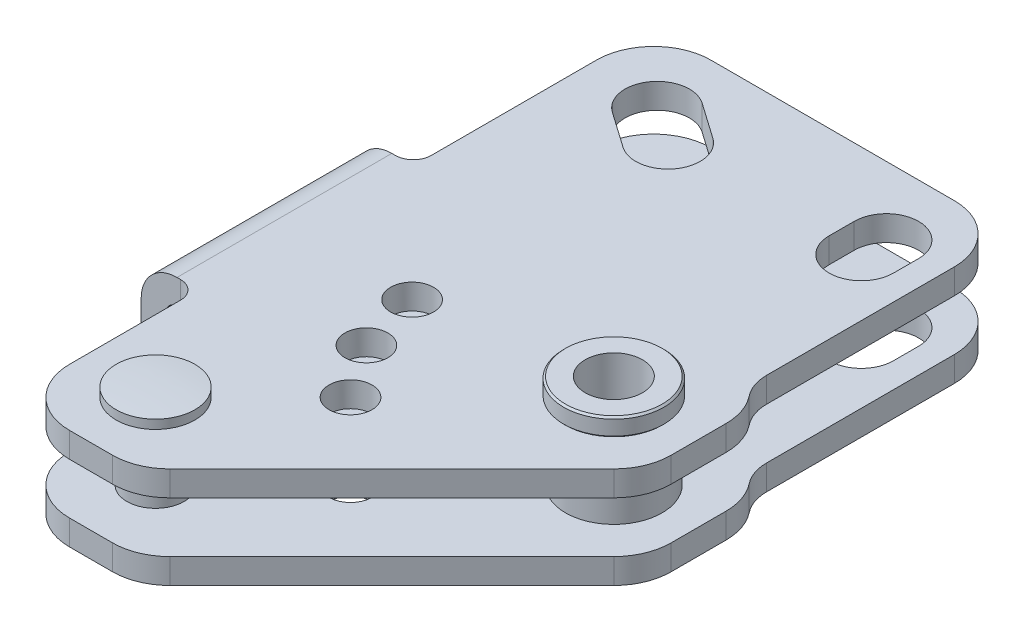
ISO-10303-21;
HEADER;
FILE_DESCRIPTION(('STEP AP214'),'2;1');
FILE_NAME('part.step','',(''),(''),'','','');
FILE_SCHEMA(('AUTOMOTIVE_DESIGN { 1 0 10303 214 1 1 1 1 }'));
ENDSEC;
DATA;
#1=APPLICATION_CONTEXT('core data for automotive mechanical design processes');
#2=APPLICATION_PROTOCOL_DEFINITION('international standard','automotive_design',2000,#1);
#3=PRODUCT_CONTEXT('',#1,'mechanical');
#4=PRODUCT('Part','Part','',(#3));
#5=PRODUCT_RELATED_PRODUCT_CATEGORY('part','',(#4));
#6=PRODUCT_DEFINITION_FORMATION('','',#4);
#7=PRODUCT_DEFINITION_CONTEXT('part definition',#1,'design');
#8=PRODUCT_DEFINITION('design','',#6,#7);
#9=PRODUCT_DEFINITION_SHAPE('','',#8);
#10=(LENGTH_UNIT() NAMED_UNIT(*) SI_UNIT(.MILLI.,.METRE.));
#11=(NAMED_UNIT(*) PLANE_ANGLE_UNIT() SI_UNIT($,.RADIAN.));
#12=(NAMED_UNIT(*) SI_UNIT($,.STERADIAN.) SOLID_ANGLE_UNIT());
#13=UNCERTAINTY_MEASURE_WITH_UNIT(LENGTH_MEASURE(1.E-05),#10,'distance_accuracy_value','');
#14=(GEOMETRIC_REPRESENTATION_CONTEXT(3) GLOBAL_UNCERTAINTY_ASSIGNED_CONTEXT((#13)) GLOBAL_UNIT_ASSIGNED_CONTEXT((#10,
#11,#12)) REPRESENTATION_CONTEXT('',''));
#15=CARTESIAN_POINT('',(0.,0.,0.));
#16=DIRECTION('',(0.,0.,1.));
#17=DIRECTION('',(1.,0.,0.));
#18=AXIS2_PLACEMENT_3D('',#15,#16,#17);
#19=CARTESIAN_POINT('',(32.,-9.65,38.06));
#20=DIRECTION('',(0.,1.,0.));
#21=DIRECTION('',(1.,0.,0.));
#22=AXIS2_PLACEMENT_3D('',#19,#20,#21);
#23=CYLINDRICAL_SURFACE('',#22,4.);
#24=CARTESIAN_POINT('',(32.,9.6,38.06));
#25=DIRECTION('',(0.,1.,0.));
#26=DIRECTION('',(-1.,0.,0.));
#27=AXIS2_PLACEMENT_3D('',#24,#25,#26);
#28=CIRCLE('',#27,4.);
#29=CARTESIAN_POINT('',(28.,9.6,38.06));
#30=VERTEX_POINT('',#29);
#31=EDGE_CURVE('E408',#30,#30,#28,.F.);
#32=ORIENTED_EDGE('',*,*,#31,.F.);
#33=EDGE_LOOP('',(#32));
#34=FACE_BOUND('',#33,.T.);
#35=CARTESIAN_POINT('',(32.,-9.6,38.06));
#36=DIRECTION('',(0.,-1.,0.));
#37=DIRECTION('',(1.,0.,0.));
#38=AXIS2_PLACEMENT_3D('',#35,#36,#37);
#39=CIRCLE('',#38,4.);
#40=CARTESIAN_POINT('',(36.,-9.6,38.06));
#41=VERTEX_POINT('',#40);
#42=EDGE_CURVE('E412',#41,#41,#39,.T.);
#43=ORIENTED_EDGE('',*,*,#42,.T.);
#44=EDGE_LOOP('',(#43));
#45=FACE_BOUND('',#44,.T.);
#46=ADVANCED_FACE('F14',(#34,#45),#23,.F.);
#47=CARTESIAN_POINT('',(32.,-7.05,38.06));
#48=DIRECTION('',(0.,-1.,0.));
#49=DIRECTION('',(-1.,0.,0.));
#50=AXIS2_PLACEMENT_3D('',#47,#48,#49);
#51=CYLINDRICAL_SURFACE('',#50,7.);
#52=CARTESIAN_POINT('',(32.,-9.35,38.06));
#53=DIRECTION('',(0.,-1.,0.));
#54=DIRECTION('',(1.,0.,0.));
#55=AXIS2_PLACEMENT_3D('',#52,#53,#54);
#56=CIRCLE('',#55,7.);
#57=CARTESIAN_POINT('',(39.,-9.35,38.06));
#58=VERTEX_POINT('',#57);
#59=EDGE_CURVE('E9',#58,#58,#56,.F.);
#60=ORIENTED_EDGE('',*,*,#59,.T.);
#61=EDGE_LOOP('',(#60));
#62=FACE_BOUND('',#61,.T.);
#63=CARTESIAN_POINT('',(32.,-7.25,38.06));
#64=DIRECTION('',(0.,-1.,0.));
#65=DIRECTION('',(-1.,0.,0.));
#66=AXIS2_PLACEMENT_3D('',#63,#64,#65);
#67=CIRCLE('',#66,7.);
#68=CARTESIAN_POINT('',(25.,-7.25,38.06));
#69=VERTEX_POINT('',#68);
#70=EDGE_CURVE('E432',#69,#69,#67,.T.);
#71=ORIENTED_EDGE('',*,*,#70,.T.);
#72=EDGE_LOOP('',(#71));
#73=FACE_BOUND('',#72,.T.);
#74=ADVANCED_FACE('F986',(#62,#73),#51,.T.);
#75=CARTESIAN_POINT('',(32.,-9.65,38.06));
#76=DIRECTION('',(0.,1.,0.));
#77=DIRECTION('',(1.,0.,0.));
#78=AXIS2_PLACEMENT_3D('',#75,#76,#77);
#79=CYLINDRICAL_SURFACE('',#78,7.);
#80=CARTESIAN_POINT('',(32.,9.35,38.06));
#81=DIRECTION('',(0.,1.,0.));
#82=DIRECTION('',(-1.,0.,0.));
#83=AXIS2_PLACEMENT_3D('',#80,#81,#82);
#84=CIRCLE('',#83,7.);
#85=CARTESIAN_POINT('',(25.,9.35,38.06));
#86=VERTEX_POINT('',#85);
#87=EDGE_CURVE('E416',#86,#86,#84,.F.);
#88=ORIENTED_EDGE('',*,*,#87,.T.);
#89=EDGE_LOOP('',(#88));
#90=FACE_BOUND('',#89,.T.);
#91=CARTESIAN_POINT('',(32.,7.3,38.06));
#92=DIRECTION('',(0.,1.,0.));
#93=DIRECTION('',(1.,0.,0.));
#94=AXIS2_PLACEMENT_3D('',#91,#92,#93);
#95=CIRCLE('',#94,7.);
#96=CARTESIAN_POINT('',(39.,7.3,38.06));
#97=VERTEX_POINT('',#96);
#98=EDGE_CURVE('E438',#97,#97,#95,.T.);
#99=ORIENTED_EDGE('',*,*,#98,.T.);
#100=EDGE_LOOP('',(#99));
#101=FACE_BOUND('',#100,.T.);
#102=ADVANCED_FACE('F975',(#90,#101),#79,.T.);
#103=CARTESIAN_POINT('',(32.,-7.05,38.06));
#104=DIRECTION('',(0.,-1.,0.));
#105=DIRECTION('',(-1.,0.,0.));
#106=AXIS2_PLACEMENT_3D('',#103,#104,#105);
#107=CONICAL_SURFACE('',#106,6.8,0.785398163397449);
#108=ORIENTED_EDGE('',*,*,#70,.F.);
#109=EDGE_LOOP('',(#108));
#110=FACE_BOUND('',#109,.T.);
#111=CARTESIAN_POINT('',(32.,-7.05,38.06));
#112=DIRECTION('',(0.,-1.,0.));
#113=DIRECTION('',(-1.,0.,0.));
#114=AXIS2_PLACEMENT_3D('',#111,#112,#113);
#115=CIRCLE('',#114,6.8);
#116=CARTESIAN_POINT('',(25.2,-7.05,38.06));
#117=VERTEX_POINT('',#116);
#118=EDGE_CURVE('E417',#117,#117,#115,.T.);
#119=ORIENTED_EDGE('',*,*,#118,.T.);
#120=EDGE_LOOP('',(#119));
#121=FACE_BOUND('',#120,.T.);
#122=ADVANCED_FACE('F972',(#110,#121),#107,.T.);
#123=CARTESIAN_POINT('',(0.,-5.95,70.06));
#124=DIRECTION('',(0.,-1.,0.));
#125=DIRECTION('',(0.,0.,1.));
#126=AXIS2_PLACEMENT_3D('',#123,#124,#125);
#127=CONICAL_SURFACE('',#126,2.75,1.04719755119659);
#128=CARTESIAN_POINT('',(0.,-4.3622867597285,70.06));
#129=VERTEX_POINT('',#128);
#130=VERTEX_LOOP('',#129);
#131=FACE_BOUND('',#130,.T.);
#132=CARTESIAN_POINT('',(0.,-5.95,70.06));
#133=DIRECTION('',(0.,1.,0.));
#134=DIRECTION('',(0.,0.,-1.));
#135=AXIS2_PLACEMENT_3D('',#132,#133,#134);
#136=CIRCLE('',#135,2.75);
#137=CARTESIAN_POINT('',(0.,-5.95,67.31));
#138=VERTEX_POINT('',#137);
#139=EDGE_CURVE('E394',#138,#138,#136,.T.);
#140=ORIENTED_EDGE('',*,*,#139,.F.);
#141=EDGE_LOOP('',(#140));
#142=FACE_BOUND('',#141,.T.);
#143=ADVANCED_FACE('F974',(#131,#142),#127,.F.);
#144=CARTESIAN_POINT('',(0.,-51.4499999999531,70.0600000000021));
#145=DIRECTION('',(0.,1.,0.));
#146=DIRECTION('',(0.,0.,-1.));
#147=AXIS2_PLACEMENT_3D('',#144,#145,#146);
#148=SPHERICAL_SURFACE('',#147,59.9999999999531);
#149=CARTESIAN_POINT('',(0.,8.2973848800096,70.06));
#150=DIRECTION('',(0.,1.,0.));
#151=DIRECTION('',(0.,0.,-1.));
#152=AXIS2_PLACEMENT_3D('',#149,#150,#151);
#153=CIRCLE('',#152,5.5);
#154=CARTESIAN_POINT('',(0.,8.2973848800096,64.56));
#155=VERTEX_POINT('',#154);
#156=EDGE_CURVE('E455',#155,#155,#153,.T.);
#157=ORIENTED_EDGE('',*,*,#156,.T.);
#158=EDGE_LOOP('',(#157));
#159=FACE_BOUND('',#158,.T.);
#160=ADVANCED_FACE('F984',(#159),#148,.T.);
#161=CARTESIAN_POINT('',(0.,-4.3622867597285,70.06));
#162=DIRECTION('',(0.,1.,0.));
#163=DIRECTION('',(0.,0.,-1.));
#164=AXIS2_PLACEMENT_3D('',#161,#162,#163);
#165=CYLINDRICAL_SURFACE('',#164,2.75);
#166=ORIENTED_EDGE('',*,*,#139,.T.);
#167=EDGE_LOOP('',(#166));
#168=FACE_BOUND('',#167,.T.);
#169=CARTESIAN_POINT('',(0.,-8.3869460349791,70.06));
#170=DIRECTION('',(0.,1.,0.));
#171=DIRECTION('',(0.,0.,-1.));
#172=AXIS2_PLACEMENT_3D('',#169,#170,#171);
#173=CIRCLE('',#172,2.75);
#174=CARTESIAN_POINT('',(0.,-8.3869460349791,72.8099999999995));
#175=VERTEX_POINT('',#174);
#176=EDGE_CURVE('E446',#175,#175,#173,.T.);
#177=ORIENTED_EDGE('',*,*,#176,.F.);
#178=EDGE_LOOP('',(#177));
#179=FACE_BOUND('',#178,.T.);
#180=ADVANCED_FACE('F1004',(#168,#179),#165,.F.);
#181=CARTESIAN_POINT('',(32.,7.05,38.06));
#182=DIRECTION('',(0.,1.,0.));
#183=DIRECTION('',(1.,0.,0.));
#184=AXIS2_PLACEMENT_3D('',#181,#182,#183);
#185=CONICAL_SURFACE('',#184,6.75,0.785398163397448);
#186=ORIENTED_EDGE('',*,*,#98,.F.);
#187=EDGE_LOOP('',(#186));
#188=FACE_BOUND('',#187,.T.);
#189=CARTESIAN_POINT('',(32.,7.05,38.06));
#190=DIRECTION('',(0.,1.,0.));
#191=DIRECTION('',(1.,0.,0.));
#192=AXIS2_PLACEMENT_3D('',#189,#190,#191);
#193=CIRCLE('',#192,6.75);
#194=CARTESIAN_POINT('',(38.75,7.05,38.06));
#195=VERTEX_POINT('',#194);
#196=EDGE_CURVE('E435',#195,#195,#193,.T.);
#197=ORIENTED_EDGE('',*,*,#196,.T.);
#198=EDGE_LOOP('',(#197));
#199=FACE_BOUND('',#198,.T.);
#200=ADVANCED_FACE('F1002',(#188,#199),#185,.T.);
#201=CARTESIAN_POINT('',(0.,-4.3622867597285,70.06));
#202=DIRECTION('',(0.,1.,0.));
#203=DIRECTION('',(0.,0.,-1.));
#204=AXIS2_PLACEMENT_3D('',#201,#202,#203);
#205=CYLINDRICAL_SURFACE('',#204,5.5);
#206=CARTESIAN_POINT('',(0.,7.05,70.06));
#207=DIRECTION('',(0.,1.,0.));
#208=DIRECTION('',(0.,0.,-1.));
#209=AXIS2_PLACEMENT_3D('',#206,#207,#208);
#210=CIRCLE('',#209,5.5);
#211=CARTESIAN_POINT('',(0.,7.05,64.56));
#212=VERTEX_POINT('',#211);
#213=EDGE_CURVE('E452',#212,#212,#210,.T.);
#214=ORIENTED_EDGE('',*,*,#213,.T.);
#215=EDGE_LOOP('',(#214));
#216=FACE_BOUND('',#215,.T.);
#217=ORIENTED_EDGE('',*,*,#156,.F.);
#218=EDGE_LOOP('',(#217));
#219=FACE_BOUND('',#218,.T.);
#220=ADVANCED_FACE('F1022',(#216,#219),#205,.T.);
#221=CARTESIAN_POINT('',(7.580580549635,7.05,-0.1865436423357));
#222=DIRECTION('',(-0.573462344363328,0.,0.81923192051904));
#223=DIRECTION('',(0.819231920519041,0.,0.573462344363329));
#224=AXIS2_PLACEMENT_3D('',#221,#222,#223);
#225=PLANE('',#224);
#226=DIRECTION('',(0.,-1.,0.));
#227=VECTOR('',#226,1.);
#228=CARTESIAN_POINT('',(7.580580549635,7.05,-0.1865436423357));
#229=LINE('',#228,#227);
#230=CARTESIAN_POINT('',(7.580580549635,7.05,-0.1865436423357));
#231=VERTEX_POINT('',#230);
#232=CARTESIAN_POINT('',(7.580580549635,3.55,-0.1865436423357));
#233=VERTEX_POINT('',#232);
#234=EDGE_CURVE('E470',#231,#233,#229,.T.);
#235=ORIENTED_EDGE('',*,*,#234,.F.);
#236=DIRECTION('',(-0.81923192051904,0.,-0.573462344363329));
#237=VECTOR('',#236,1.);
#238=CARTESIAN_POINT('',(7.580580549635,7.05,-0.1865436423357));
#239=LINE('',#238,#237);
#240=CARTESIAN_POINT('',(2.580580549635,7.05,-3.6865436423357));
#241=VERTEX_POINT('',#240);
#242=EDGE_CURVE('E464',#231,#241,#239,.T.);
#243=ORIENTED_EDGE('',*,*,#242,.T.);
#244=DIRECTION('',(0.,-1.,0.));
#245=VECTOR('',#244,1.);
#246=CARTESIAN_POINT('',(2.580580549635,7.05,-3.6865436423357));
#247=LINE('',#246,#245);
#248=CARTESIAN_POINT('',(2.580580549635,3.55,-3.6865436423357));
#249=VERTEX_POINT('',#248);
#250=EDGE_CURVE('E384',#241,#249,#247,.T.);
#251=ORIENTED_EDGE('',*,*,#250,.T.);
#252=DIRECTION('',(-0.81923192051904,0.,-0.573462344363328));
#253=VECTOR('',#252,1.);
#254=CARTESIAN_POINT('',(71.4007147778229,3.55,44.4875503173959));
#255=LINE('',#254,#253);
#256=EDGE_CURVE('E399',#233,#249,#255,.T.);
#257=ORIENTED_EDGE('',*,*,#256,.F.);
#258=EDGE_LOOP('',(#235,#243,#251,#257));
#259=FACE_BOUND('',#258,.T.);
#260=ADVANCED_FACE('F1025',(#259),#225,.T.);
#261=CARTESIAN_POINT('',(5.,7.05,3.50000000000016));
#262=DIRECTION('',(0.,-1.,0.));
#263=DIRECTION('',(1.,0.,0.));
#264=AXIS2_PLACEMENT_3D('',#261,#262,#263);
#265=CYLINDRICAL_SURFACE('',#264,4.50000000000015);
#266=DIRECTION('',(0.,-1.,0.));
#267=VECTOR('',#266,1.);
#268=CARTESIAN_POINT('',(2.419419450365,7.05,7.186543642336));
#269=LINE('',#268,#267);
#270=CARTESIAN_POINT('',(2.419419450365,7.05,7.186543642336));
#271=VERTEX_POINT('',#270);
#272=CARTESIAN_POINT('',(2.419419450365,3.55,7.186543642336));
#273=VERTEX_POINT('',#272);
#274=EDGE_CURVE('E391',#271,#273,#269,.T.);
#275=ORIENTED_EDGE('',*,*,#274,.F.);
#276=CARTESIAN_POINT('',(5.,7.05,3.50000000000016));
#277=DIRECTION('',(0.,1.,0.));
#278=DIRECTION('',(-1.,0.,0.));
#279=AXIS2_PLACEMENT_3D('',#276,#277,#278);
#280=CIRCLE('',#279,4.50000000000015);
#281=EDGE_CURVE('E462',#271,#231,#280,.T.);
#282=ORIENTED_EDGE('',*,*,#281,.T.);
#283=ORIENTED_EDGE('',*,*,#234,.T.);
#284=CARTESIAN_POINT('',(5.,3.55,3.50000000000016));
#285=DIRECTION('',(0.,-1.,0.));
#286=DIRECTION('',(1.,0.,0.));
#287=AXIS2_PLACEMENT_3D('',#284,#285,#286);
#288=CIRCLE('',#287,4.50000000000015);
#289=EDGE_CURVE('E395',#273,#233,#288,.F.);
#290=ORIENTED_EDGE('',*,*,#289,.F.);
#291=EDGE_LOOP('',(#275,#282,#283,#290));
#292=FACE_BOUND('',#291,.T.);
#293=ADVANCED_FACE('F1035',(#292),#265,.F.);
#294=CARTESIAN_POINT('',(-2.58058054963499,7.05,3.686543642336));
#295=DIRECTION('',(0.573462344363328,0.,-0.819231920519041));
#296=DIRECTION('',(-0.819231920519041,0.,-0.573462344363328));
#297=AXIS2_PLACEMENT_3D('',#294,#295,#296);
#298=PLANE('',#297);
#299=DIRECTION('',(0.,-1.,0.));
#300=VECTOR('',#299,1.);
#301=CARTESIAN_POINT('',(-2.58058054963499,7.05,3.686543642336));
#302=LINE('',#301,#300);
#303=CARTESIAN_POINT('',(-2.58058054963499,7.05,3.686543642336));
#304=VERTEX_POINT('',#303);
#305=CARTESIAN_POINT('',(-2.58058054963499,3.55,3.686543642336));
#306=VERTEX_POINT('',#305);
#307=EDGE_CURVE('E374',#304,#306,#302,.T.);
#308=ORIENTED_EDGE('',*,*,#307,.F.);
#309=DIRECTION('',(0.819231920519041,0.,0.573462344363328));
#310=VECTOR('',#309,1.);
#311=CARTESIAN_POINT('',(-2.58058054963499,7.05,3.686543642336));
#312=LINE('',#311,#310);
#313=EDGE_CURVE('E411',#304,#271,#312,.T.);
#314=ORIENTED_EDGE('',*,*,#313,.T.);
#315=ORIENTED_EDGE('',*,*,#274,.T.);
#316=DIRECTION('',(0.819231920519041,0.,0.573462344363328));
#317=VECTOR('',#316,1.);
#318=CARTESIAN_POINT('',(66.2395536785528,3.55,51.8606376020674));
#319=LINE('',#318,#317);
#320=EDGE_CURVE('E388',#306,#273,#319,.T.);
#321=ORIENTED_EDGE('',*,*,#320,.F.);
#322=EDGE_LOOP('',(#308,#314,#315,#321));
#323=FACE_BOUND('',#322,.T.);
#324=ADVANCED_FACE('F389',(#323),#298,.T.);
#325=CARTESIAN_POINT('',(0.,7.05,0.));
#326=DIRECTION('',(0.,-1.,0.));
#327=DIRECTION('',(1.,0.,0.));
#328=AXIS2_PLACEMENT_3D('',#325,#326,#327);
#329=CYLINDRICAL_SURFACE('',#328,4.50000000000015);
#330=ORIENTED_EDGE('',*,*,#250,.F.);
#331=CARTESIAN_POINT('',(0.,7.05,0.));
#332=DIRECTION('',(0.,1.,0.));
#333=DIRECTION('',(1.,0.,0.));
#334=AXIS2_PLACEMENT_3D('',#331,#332,#333);
#335=CIRCLE('',#334,4.50000000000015);
#336=EDGE_CURVE('E381',#241,#304,#335,.T.);
#337=ORIENTED_EDGE('',*,*,#336,.T.);
#338=ORIENTED_EDGE('',*,*,#307,.T.);
#339=CARTESIAN_POINT('',(0.,3.55,0.));
#340=DIRECTION('',(0.,-1.,0.));
#341=DIRECTION('',(1.,0.,0.));
#342=AXIS2_PLACEMENT_3D('',#339,#340,#341);
#343=CIRCLE('',#342,4.50000000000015);
#344=EDGE_CURVE('E378',#249,#306,#343,.F.);
#345=ORIENTED_EDGE('',*,*,#344,.F.);
#346=EDGE_LOOP('',(#330,#337,#338,#345));
#347=FACE_BOUND('',#346,.T.);
#348=ADVANCED_FACE('F376',(#347),#329,.F.);
#349=CARTESIAN_POINT('',(13.61522368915,7.05,56.44477631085));
#350=DIRECTION('',(0.,-1.,0.));
#351=DIRECTION('',(1.,0.,0.));
#352=AXIS2_PLACEMENT_3D('',#349,#350,#351);
#353=CYLINDRICAL_SURFACE('',#352,3.);
#354=CARTESIAN_POINT('',(13.61522368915,3.55,56.44477631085));
#355=DIRECTION('',(0.,-1.,0.));
#356=DIRECTION('',(1.,0.,0.));
#357=AXIS2_PLACEMENT_3D('',#354,#355,#356);
#358=CIRCLE('',#357,3.);
#359=CARTESIAN_POINT('',(16.61522368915,3.55,56.44477631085));
#360=VERTEX_POINT('',#359);
#361=EDGE_CURVE('E543',#360,#360,#358,.F.);
#362=ORIENTED_EDGE('',*,*,#361,.F.);
#363=EDGE_LOOP('',(#362));
#364=FACE_BOUND('',#363,.T.);
#365=CARTESIAN_POINT('',(13.61522368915,7.05,56.44477631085));
#366=DIRECTION('',(0.,1.,0.));
#367=DIRECTION('',(-1.,0.,0.));
#368=AXIS2_PLACEMENT_3D('',#365,#366,#367);
#369=CIRCLE('',#368,3.);
#370=CARTESIAN_POINT('',(10.61522368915,7.05,56.44477631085));
#371=VERTEX_POINT('',#370);
#372=EDGE_CURVE('E540',#371,#371,#369,.T.);
#373=ORIENTED_EDGE('',*,*,#372,.T.);
#374=EDGE_LOOP('',(#373));
#375=FACE_BOUND('',#374,.T.);
#376=ADVANCED_FACE('F1032',(#364,#375),#353,.F.);
#377=CARTESIAN_POINT('',(6.098937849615,7.05,40.326049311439));
#378=DIRECTION('',(0.,-1.,0.));
#379=DIRECTION('',(1.,0.,0.));
#380=AXIS2_PLACEMENT_3D('',#377,#378,#379);
#381=CYLINDRICAL_SURFACE('',#380,3.);
#382=CARTESIAN_POINT('',(6.098937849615,3.55,40.326049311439));
#383=DIRECTION('',(0.,-1.,0.));
#384=DIRECTION('',(1.,0.,0.));
#385=AXIS2_PLACEMENT_3D('',#382,#383,#384);
#386=CIRCLE('',#385,3.);
#387=CARTESIAN_POINT('',(9.098937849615,3.55,40.326049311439));
#388=VERTEX_POINT('',#387);
#389=EDGE_CURVE('E559',#388,#388,#386,.F.);
#390=ORIENTED_EDGE('',*,*,#389,.F.);
#391=EDGE_LOOP('',(#390));
#392=FACE_BOUND('',#391,.T.);
#393=CARTESIAN_POINT('',(6.098937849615,7.05,40.326049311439));
#394=DIRECTION('',(0.,1.,0.));
#395=DIRECTION('',(-1.,0.,0.));
#396=AXIS2_PLACEMENT_3D('',#393,#394,#395);
#397=CIRCLE('',#396,3.);
#398=CARTESIAN_POINT('',(3.098937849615,7.05,40.326049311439));
#399=VERTEX_POINT('',#398);
#400=EDGE_CURVE('E556',#399,#399,#397,.T.);
#401=ORIENTED_EDGE('',*,*,#400,.T.);
#402=EDGE_LOOP('',(#401));
#403=FACE_BOUND('',#402,.T.);
#404=ADVANCED_FACE('F1085',(#392,#403),#381,.F.);
#405=CARTESIAN_POINT('',(-1.9999999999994,-7.05,-1.49999999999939));
#406=DIRECTION('',(0.,1.,0.));
#407=DIRECTION('',(-1.,0.,0.));
#408=AXIS2_PLACEMENT_3D('',#405,#406,#407);
#409=CYLINDRICAL_SURFACE('',#408,8.00000000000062);
#410=DIRECTION('',(0.,1.,0.));
#411=VECTOR('',#410,1.);
#412=CARTESIAN_POINT('',(-2.,-7.05,-9.5));
#413=LINE('',#412,#411);
#414=CARTESIAN_POINT('',(-1.9999999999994,3.55,-9.5));
#415=VERTEX_POINT('',#414);
#416=CARTESIAN_POINT('',(-2.,7.05,-9.5));
#417=VERTEX_POINT('',#416);
#418=EDGE_CURVE('E861',#415,#417,#413,.T.);
#419=ORIENTED_EDGE('',*,*,#418,.F.);
#420=CARTESIAN_POINT('',(-1.9999999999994,3.55,-1.49999999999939));
#421=DIRECTION('',(0.,-1.,0.));
#422=DIRECTION('',(1.,0.,0.));
#423=AXIS2_PLACEMENT_3D('',#420,#421,#422);
#424=CIRCLE('',#423,8.00000000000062);
#425=CARTESIAN_POINT('',(-10.,3.55,-1.49999999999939));
#426=VERTEX_POINT('',#425);
#427=EDGE_CURVE('E652',#415,#426,#424,.F.);
#428=ORIENTED_EDGE('',*,*,#427,.T.);
#429=DIRECTION('',(0.,1.,0.));
#430=VECTOR('',#429,1.);
#431=CARTESIAN_POINT('',(-10.,-7.05,-1.49999999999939));
#432=LINE('',#431,#430);
#433=CARTESIAN_POINT('',(-10.,7.05,-1.49999999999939));
#434=VERTEX_POINT('',#433);
#435=EDGE_CURVE('E857',#426,#434,#432,.T.);
#436=ORIENTED_EDGE('',*,*,#435,.T.);
#437=CARTESIAN_POINT('',(-1.9999999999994,7.05,-1.49999999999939));
#438=DIRECTION('',(0.,1.,0.));
#439=DIRECTION('',(1.,0.,0.));
#440=AXIS2_PLACEMENT_3D('',#437,#438,#439);
#441=CIRCLE('',#440,8.00000000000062);
#442=EDGE_CURVE('E725',#417,#434,#441,.T.);
#443=ORIENTED_EDGE('',*,*,#442,.F.);
#444=EDGE_LOOP('',(#419,#428,#436,#443));
#445=FACE_BOUND('',#444,.T.);
#446=ADVANCED_FACE('F1101',(#445),#409,.T.);
#447=CARTESIAN_POINT('',(-10.,-7.05,-1.5));
#448=DIRECTION('',(-1.,0.,0.));
#449=DIRECTION('',(0.,-1.,0.));
#450=AXIS2_PLACEMENT_3D('',#447,#448,#449);
#451=PLANE('',#450);
#452=ORIENTED_EDGE('',*,*,#435,.F.);
#453=DIRECTION('',(0.,0.,1.));
#454=VECTOR('',#453,1.);
#455=CARTESIAN_POINT('',(-10.,3.55,-1.5));
#456=LINE('',#455,#454);
#457=CARTESIAN_POINT('',(-10.,3.55,21.5599999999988));
#458=VERTEX_POINT('',#457);
#459=EDGE_CURVE('E649',#426,#458,#456,.T.);
#460=ORIENTED_EDGE('',*,*,#459,.T.);
#461=DIRECTION('',(0.,1.,0.));
#462=VECTOR('',#461,1.);
#463=CARTESIAN_POINT('',(-10.,-7.05,21.56));
#464=LINE('',#463,#462);
#465=CARTESIAN_POINT('',(-10.,7.05,21.56));
#466=VERTEX_POINT('',#465);
#467=EDGE_CURVE('E853',#458,#466,#464,.T.);
#468=ORIENTED_EDGE('',*,*,#467,.T.);
#469=DIRECTION('',(0.,0.,1.));
#470=VECTOR('',#469,1.);
#471=CARTESIAN_POINT('',(-10.,7.05,-1.5));
#472=LINE('',#471,#470);
#473=EDGE_CURVE('E727',#434,#466,#472,.T.);
#474=ORIENTED_EDGE('',*,*,#473,.F.);
#475=EDGE_LOOP('',(#452,#460,#468,#474));
#476=FACE_BOUND('',#475,.T.);
#477=ADVANCED_FACE('F1192',(#476),#451,.T.);
#478=CARTESIAN_POINT('',(-10.,-7.05,56.56));
#479=DIRECTION('',(-1.,0.,0.));
#480=DIRECTION('',(0.,-1.,0.));
#481=AXIS2_PLACEMENT_3D('',#478,#479,#480);
#482=PLANE('',#481);
#483=DIRECTION('',(0.,1.,0.));
#484=VECTOR('',#483,1.);
#485=CARTESIAN_POINT('',(-10.,-7.05,56.56));
#486=LINE('',#485,#484);
#487=CARTESIAN_POINT('',(-10.,3.55,56.56));
#488=VERTEX_POINT('',#487);
#489=CARTESIAN_POINT('',(-10.,7.05,56.56));
#490=VERTEX_POINT('',#489);
#491=EDGE_CURVE('E835',#488,#490,#486,.T.);
#492=ORIENTED_EDGE('',*,*,#491,.F.);
#493=DIRECTION('',(0.,0.,1.));
#494=VECTOR('',#493,1.);
#495=CARTESIAN_POINT('',(-10.,3.55,56.56));
#496=LINE('',#495,#494);
#497=CARTESIAN_POINT('',(-10.,3.55,72.06));
#498=VERTEX_POINT('',#497);
#499=EDGE_CURVE('E634',#488,#498,#496,.T.);
#500=ORIENTED_EDGE('',*,*,#499,.T.);
#501=DIRECTION('',(0.,1.,0.));
#502=VECTOR('',#501,1.);
#503=CARTESIAN_POINT('',(-10.,-7.05,72.06));
#504=LINE('',#503,#502);
#505=CARTESIAN_POINT('',(-10.,7.05,72.06));
#506=VERTEX_POINT('',#505);
#507=EDGE_CURVE('E831',#498,#506,#504,.T.);
#508=ORIENTED_EDGE('',*,*,#507,.T.);
#509=DIRECTION('',(0.,0.,1.));
#510=VECTOR('',#509,1.);
#511=CARTESIAN_POINT('',(-10.,7.05,56.56));
#512=LINE('',#511,#510);
#513=EDGE_CURVE('E741',#490,#506,#512,.T.);
#514=ORIENTED_EDGE('',*,*,#513,.F.);
#515=EDGE_LOOP('',(#492,#500,#508,#514));
#516=FACE_BOUND('',#515,.T.);
#517=ADVANCED_FACE('F1172',(#516),#482,.T.);
#518=CARTESIAN_POINT('',(-1.9999999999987,-7.05,72.0599999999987));
#519=DIRECTION('',(0.,1.,0.));
#520=DIRECTION('',(-1.,0.,0.));
#521=AXIS2_PLACEMENT_3D('',#518,#519,#520);
#522=CYLINDRICAL_SURFACE('',#521,8.00000000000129);
#523=ORIENTED_EDGE('',*,*,#507,.F.);
#524=CARTESIAN_POINT('',(-1.9999999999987,3.55,72.0599999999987));
#525=DIRECTION('',(0.,-1.,0.));
#526=DIRECTION('',(1.,0.,0.));
#527=AXIS2_PLACEMENT_3D('',#524,#525,#526);
#528=CIRCLE('',#527,8.00000000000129);
#529=CARTESIAN_POINT('',(-2.,3.55,80.06));
#530=VERTEX_POINT('',#529);
#531=EDGE_CURVE('E631',#498,#530,#528,.F.);
#532=ORIENTED_EDGE('',*,*,#531,.T.);
#533=DIRECTION('',(0.,1.,0.));
#534=VECTOR('',#533,1.);
#535=CARTESIAN_POINT('',(-2.,-7.05,80.06));
#536=LINE('',#535,#534);
#537=CARTESIAN_POINT('',(-2.,7.05,80.06));
#538=VERTEX_POINT('',#537);
#539=EDGE_CURVE('E827',#530,#538,#536,.T.);
#540=ORIENTED_EDGE('',*,*,#539,.T.);
#541=CARTESIAN_POINT('',(-1.9999999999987,7.05,72.0599999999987));
#542=DIRECTION('',(0.,1.,0.));
#543=DIRECTION('',(-1.,0.,0.));
#544=AXIS2_PLACEMENT_3D('',#541,#542,#543);
#545=CIRCLE('',#544,8.00000000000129);
#546=EDGE_CURVE('E744',#506,#538,#545,.T.);
#547=ORIENTED_EDGE('',*,*,#546,.F.);
#548=EDGE_LOOP('',(#523,#532,#540,#547));
#549=FACE_BOUND('',#548,.T.);
#550=ADVANCED_FACE('F1167',(#549),#522,.T.);
#551=CARTESIAN_POINT('',(-2.,-7.05,80.06));
#552=DIRECTION('',(0.,0.,1.));
#553=DIRECTION('',(0.,1.,0.));
#554=AXIS2_PLACEMENT_3D('',#551,#552,#553);
#555=PLANE('',#554);
#556=ORIENTED_EDGE('',*,*,#539,.F.);
#557=DIRECTION('',(-1.,0.,0.));
#558=VECTOR('',#557,1.);
#559=CARTESIAN_POINT('',(46.5,3.55,80.06));
#560=LINE('',#559,#558);
#561=CARTESIAN_POINT('',(4.,3.55,80.06));
#562=VERTEX_POINT('',#561);
#563=EDGE_CURVE('E595',#562,#530,#560,.T.);
#564=ORIENTED_EDGE('',*,*,#563,.F.);
#565=DIRECTION('',(0.,1.,0.));
#566=VECTOR('',#565,1.);
#567=CARTESIAN_POINT('',(4.,-7.05,80.06));
#568=LINE('',#567,#566);
#569=CARTESIAN_POINT('',(4.,7.05,80.06));
#570=VERTEX_POINT('',#569);
#571=EDGE_CURVE('E823',#562,#570,#568,.T.);
#572=ORIENTED_EDGE('',*,*,#571,.T.);
#573=DIRECTION('',(1.,0.,0.));
#574=VECTOR('',#573,1.);
#575=CARTESIAN_POINT('',(-2.,7.05,80.06));
#576=LINE('',#575,#574);
#577=EDGE_CURVE('E746',#538,#570,#576,.T.);
#578=ORIENTED_EDGE('',*,*,#577,.F.);
#579=EDGE_LOOP('',(#556,#564,#572,#578));
#580=FACE_BOUND('',#579,.T.);
#581=ADVANCED_FACE('F1162',(#580),#555,.T.);
#582=CARTESIAN_POINT('',(4.,-7.05,72.0600000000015));
#583=DIRECTION('',(0.,1.,0.));
#584=DIRECTION('',(-1.,0.,0.));
#585=AXIS2_PLACEMENT_3D('',#582,#583,#584);
#586=CYLINDRICAL_SURFACE('',#585,7.99999999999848);
#587=ORIENTED_EDGE('',*,*,#571,.F.);
#588=CARTESIAN_POINT('',(4.,3.55,72.0600000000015));
#589=DIRECTION('',(0.,-1.,0.));
#590=DIRECTION('',(1.,0.,0.));
#591=AXIS2_PLACEMENT_3D('',#588,#589,#590);
#592=CIRCLE('',#591,7.99999999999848);
#593=CARTESIAN_POINT('',(9.656854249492,3.55,77.716854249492));
#594=VERTEX_POINT('',#593);
#595=EDGE_CURVE('E613',#562,#594,#592,.F.);
#596=ORIENTED_EDGE('',*,*,#595,.T.);
#597=DIRECTION('',(0.,1.,0.));
#598=VECTOR('',#597,1.);
#599=CARTESIAN_POINT('',(9.656854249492,-7.05,77.716854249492));
#600=LINE('',#599,#598);
#601=CARTESIAN_POINT('',(9.656854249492,7.05,77.716854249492));
#602=VERTEX_POINT('',#601);
#603=EDGE_CURVE('E819',#594,#602,#600,.T.);
#604=ORIENTED_EDGE('',*,*,#603,.T.);
#605=CARTESIAN_POINT('',(4.,7.05,72.0600000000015));
#606=DIRECTION('',(0.,1.,0.));
#607=DIRECTION('',(-1.,0.,0.));
#608=AXIS2_PLACEMENT_3D('',#605,#606,#607);
#609=CIRCLE('',#608,7.99999999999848);
#610=EDGE_CURVE('E749',#570,#602,#609,.T.);
#611=ORIENTED_EDGE('',*,*,#610,.F.);
#612=EDGE_LOOP('',(#587,#596,#604,#611));
#613=FACE_BOUND('',#612,.T.);
#614=ADVANCED_FACE('F1157',(#613),#586,.T.);
#615=CARTESIAN_POINT('',(9.656854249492,-7.05,77.716854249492));
#616=DIRECTION('',(0.707106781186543,0.,0.707106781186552));
#617=DIRECTION('',(0.707106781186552,0.,-0.707106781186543));
#618=AXIS2_PLACEMENT_3D('',#615,#616,#617);
#619=PLANE('',#618);
#620=ORIENTED_EDGE('',*,*,#603,.F.);
#621=DIRECTION('',(0.707106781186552,0.,-0.707106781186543));
#622=VECTOR('',#621,1.);
#623=CARTESIAN_POINT('',(9.656854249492,3.55,77.716854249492));
#624=LINE('',#623,#622);
#625=CARTESIAN_POINT('',(40.6568542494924,3.55,46.716854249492));
#626=VERTEX_POINT('',#625);
#627=EDGE_CURVE('E610',#594,#626,#624,.T.);
#628=ORIENTED_EDGE('',*,*,#627,.T.);
#629=DIRECTION('',(0.,1.,0.));
#630=VECTOR('',#629,1.);
#631=CARTESIAN_POINT('',(40.6568542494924,-7.05,46.716854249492));
#632=LINE('',#631,#630);
#633=CARTESIAN_POINT('',(40.6568542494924,7.05,46.716854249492));
#634=VERTEX_POINT('',#633);
#635=EDGE_CURVE('E815',#626,#634,#632,.T.);
#636=ORIENTED_EDGE('',*,*,#635,.T.);
#637=DIRECTION('',(0.707106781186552,0.,-0.707106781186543));
#638=VECTOR('',#637,1.);
#639=CARTESIAN_POINT('',(9.656854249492,7.05,77.716854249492));
#640=LINE('',#639,#638);
#641=EDGE_CURVE('E752',#602,#634,#640,.T.);
#642=ORIENTED_EDGE('',*,*,#641,.F.);
#643=EDGE_LOOP('',(#620,#628,#636,#642));
#644=FACE_BOUND('',#643,.T.);
#645=ADVANCED_FACE('F1152',(#644),#619,.T.);
#646=CARTESIAN_POINT('',(35.0000000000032,-7.05,41.0600000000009));
#647=DIRECTION('',(0.,1.,0.));
#648=DIRECTION('',(-1.,0.,0.));
#649=AXIS2_PLACEMENT_3D('',#646,#647,#648);
#650=CYLINDRICAL_SURFACE('',#649,7.99999999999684);
#651=ORIENTED_EDGE('',*,*,#635,.F.);
#652=CARTESIAN_POINT('',(35.0000000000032,3.55,41.0600000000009));
#653=DIRECTION('',(0.,-1.,0.));
#654=DIRECTION('',(1.,0.,0.));
#655=AXIS2_PLACEMENT_3D('',#652,#653,#654);
#656=CIRCLE('',#655,7.99999999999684);
#657=CARTESIAN_POINT('',(43.,3.55,41.06));
#658=VERTEX_POINT('',#657);
#659=EDGE_CURVE('E885',#626,#658,#656,.F.);
#660=ORIENTED_EDGE('',*,*,#659,.T.);
#661=DIRECTION('',(0.,1.,0.));
#662=VECTOR('',#661,1.);
#663=CARTESIAN_POINT('',(43.,-7.05,41.06));
#664=LINE('',#663,#662);
#665=CARTESIAN_POINT('',(43.,7.05,41.06));
#666=VERTEX_POINT('',#665);
#667=EDGE_CURVE('E809',#658,#666,#664,.T.);
#668=ORIENTED_EDGE('',*,*,#667,.T.);
#669=CARTESIAN_POINT('',(35.0000000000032,7.05,41.0600000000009));
#670=DIRECTION('',(0.,1.,0.));
#671=DIRECTION('',(-1.,0.,0.));
#672=AXIS2_PLACEMENT_3D('',#669,#670,#671);
#673=CIRCLE('',#672,7.99999999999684);
#674=EDGE_CURVE('E755',#634,#666,#673,.T.);
#675=ORIENTED_EDGE('',*,*,#674,.F.);
#676=EDGE_LOOP('',(#651,#660,#668,#675));
#677=FACE_BOUND('',#676,.T.);
#678=ADVANCED_FACE('F1147',(#677),#650,.T.);
#679=CARTESIAN_POINT('',(43.,-7.05,41.06));
#680=DIRECTION('',(1.,0.,0.));
#681=DIRECTION('',(0.,1.,0.));
#682=AXIS2_PLACEMENT_3D('',#679,#680,#681);
#683=PLANE('',#682);
#684=ORIENTED_EDGE('',*,*,#667,.F.);
#685=DIRECTION('',(0.,0.,-1.));
#686=VECTOR('',#685,1.);
#687=CARTESIAN_POINT('',(43.,3.55,41.06));
#688=LINE('',#687,#686);
#689=CARTESIAN_POINT('',(43.,3.55,33.39));
#690=VERTEX_POINT('',#689);
#691=EDGE_CURVE('E616',#658,#690,#688,.T.);
#692=ORIENTED_EDGE('',*,*,#691,.T.);
#693=DIRECTION('',(0.,1.,0.));
#694=VECTOR('',#693,1.);
#695=CARTESIAN_POINT('',(43.,-7.05,33.39));
#696=LINE('',#695,#694);
#697=CARTESIAN_POINT('',(43.,7.05,33.39));
#698=VERTEX_POINT('',#697);
#699=EDGE_CURVE('E881',#690,#698,#696,.T.);
#700=ORIENTED_EDGE('',*,*,#699,.T.);
#701=DIRECTION('',(0.,0.,-1.));
#702=VECTOR('',#701,1.);
#703=CARTESIAN_POINT('',(43.,7.05,41.06));
#704=LINE('',#703,#702);
#705=EDGE_CURVE('E709',#666,#698,#704,.T.);
#706=ORIENTED_EDGE('',*,*,#705,.F.);
#707=EDGE_LOOP('',(#684,#692,#700,#706));
#708=FACE_BOUND('',#707,.T.);
#709=ADVANCED_FACE('F1222',(#708),#683,.T.);
#710=CARTESIAN_POINT('',(34.9999999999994,-7.05,33.39));
#711=DIRECTION('',(0.,1.,0.));
#712=DIRECTION('',(-1.,0.,0.));
#713=AXIS2_PLACEMENT_3D('',#710,#711,#712);
#714=CYLINDRICAL_SURFACE('',#713,8.00000000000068);
#715=ORIENTED_EDGE('',*,*,#699,.F.);
#716=CARTESIAN_POINT('',(34.9999999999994,3.55,33.39));
#717=DIRECTION('',(0.,-1.,0.));
#718=DIRECTION('',(1.,0.,0.));
#719=AXIS2_PLACEMENT_3D('',#716,#717,#718);
#720=CIRCLE('',#719,8.00000000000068);
#721=CARTESIAN_POINT('',(41.2857142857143,3.55,28.441283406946));
#722=VERTEX_POINT('',#721);
#723=EDGE_CURVE('E619',#690,#722,#720,.F.);
#724=ORIENTED_EDGE('',*,*,#723,.T.);
#725=DIRECTION('',(0.,1.,0.));
#726=VECTOR('',#725,1.);
#727=CARTESIAN_POINT('',(41.2857142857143,-7.05,28.441283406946));
#728=LINE('',#727,#726);
#729=CARTESIAN_POINT('',(41.2857142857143,7.05,28.441283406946));
#730=VERTEX_POINT('',#729);
#731=EDGE_CURVE('E877',#722,#730,#728,.T.);
#732=ORIENTED_EDGE('',*,*,#731,.T.);
#733=CARTESIAN_POINT('',(34.9999999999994,7.05,33.39));
#734=DIRECTION('',(0.,1.,0.));
#735=DIRECTION('',(-1.,0.,0.));
#736=AXIS2_PLACEMENT_3D('',#733,#734,#735);
#737=CIRCLE('',#736,8.00000000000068);
#738=EDGE_CURVE('E710',#698,#730,#737,.T.);
#739=ORIENTED_EDGE('',*,*,#738,.F.);
#740=EDGE_LOOP('',(#715,#724,#732,#739));
#741=FACE_BOUND('',#740,.T.);
#742=ADVANCED_FACE('F1219',(#741),#714,.T.);
#743=CARTESIAN_POINT('',(45.999999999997,-7.05,24.7297459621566));
#744=DIRECTION('',(0.,1.,0.));
#745=DIRECTION('',(-1.,0.,0.));
#746=AXIS2_PLACEMENT_3D('',#743,#744,#745);
#747=CYLINDRICAL_SURFACE('',#746,5.99999999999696);
#748=ORIENTED_EDGE('',*,*,#731,.F.);
#749=CARTESIAN_POINT('',(45.999999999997,3.55,24.7297459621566));
#750=DIRECTION('',(0.,-1.,0.));
#751=DIRECTION('',(1.,0.,0.));
#752=AXIS2_PLACEMENT_3D('',#749,#750,#751);
#753=CIRCLE('',#752,5.99999999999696);
#754=CARTESIAN_POINT('',(40.,3.55,24.729745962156));
#755=VERTEX_POINT('',#754);
#756=EDGE_CURVE('E622',#722,#755,#753,.T.);
#757=ORIENTED_EDGE('',*,*,#756,.T.);
#758=DIRECTION('',(0.,1.,0.));
#759=VECTOR('',#758,1.);
#760=CARTESIAN_POINT('',(40.,-7.05,24.729745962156));
#761=LINE('',#760,#759);
#762=CARTESIAN_POINT('',(40.,7.05,24.729745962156));
#763=VERTEX_POINT('',#762);
#764=EDGE_CURVE('E873',#755,#763,#761,.T.);
#765=ORIENTED_EDGE('',*,*,#764,.T.);
#766=CARTESIAN_POINT('',(45.999999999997,7.05,24.7297459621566));
#767=DIRECTION('',(0.,-1.,0.));
#768=DIRECTION('',(1.,0.,0.));
#769=AXIS2_PLACEMENT_3D('',#766,#767,#768);
#770=CIRCLE('',#769,5.99999999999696);
#771=EDGE_CURVE('E713',#730,#763,#770,.T.);
#772=ORIENTED_EDGE('',*,*,#771,.F.);
#773=EDGE_LOOP('',(#748,#757,#765,#772));
#774=FACE_BOUND('',#773,.T.);
#775=ADVANCED_FACE('F1215',(#774),#747,.F.);
#776=CARTESIAN_POINT('',(40.,-7.05,24.729745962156));
#777=DIRECTION('',(1.,0.,0.));
#778=DIRECTION('',(0.,1.,0.));
#779=AXIS2_PLACEMENT_3D('',#776,#777,#778);
#780=PLANE('',#779);
#781=ORIENTED_EDGE('',*,*,#764,.F.);
#782=DIRECTION('',(0.,0.,-1.));
#783=VECTOR('',#782,1.);
#784=CARTESIAN_POINT('',(40.,3.55,24.729745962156));
#785=LINE('',#784,#783);
#786=CARTESIAN_POINT('',(40.,3.55,-1.5));
#787=VERTEX_POINT('',#786);
#788=EDGE_CURVE('E625',#755,#787,#785,.T.);
#789=ORIENTED_EDGE('',*,*,#788,.T.);
#790=DIRECTION('',(0.,1.,0.));
#791=VECTOR('',#790,1.);
#792=CARTESIAN_POINT('',(40.,-7.05,-1.5));
#793=LINE('',#792,#791);
#794=CARTESIAN_POINT('',(40.,7.05,-1.5));
#795=VERTEX_POINT('',#794);
#796=EDGE_CURVE('E869',#787,#795,#793,.T.);
#797=ORIENTED_EDGE('',*,*,#796,.T.);
#798=DIRECTION('',(0.,0.,-1.));
#799=VECTOR('',#798,1.);
#800=CARTESIAN_POINT('',(40.,7.05,24.729745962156));
#801=LINE('',#800,#799);
#802=EDGE_CURVE('E716',#763,#795,#801,.T.);
#803=ORIENTED_EDGE('',*,*,#802,.F.);
#804=EDGE_LOOP('',(#781,#789,#797,#803));
#805=FACE_BOUND('',#804,.T.);
#806=ADVANCED_FACE('F1210',(#805),#780,.T.);
#807=CARTESIAN_POINT('',(32.,-7.05,-1.5));
#808=DIRECTION('',(0.,1.,0.));
#809=DIRECTION('',(-1.,0.,0.));
#810=AXIS2_PLACEMENT_3D('',#807,#808,#809);
#811=CYLINDRICAL_SURFACE('',#810,8.);
#812=ORIENTED_EDGE('',*,*,#796,.F.);
#813=CARTESIAN_POINT('',(32.,3.55,-1.5));
#814=DIRECTION('',(0.,-1.,0.));
#815=DIRECTION('',(1.,0.,0.));
#816=AXIS2_PLACEMENT_3D('',#813,#814,#815);
#817=CIRCLE('',#816,8.);
#818=CARTESIAN_POINT('',(32.,3.55,-9.5));
#819=VERTEX_POINT('',#818);
#820=EDGE_CURVE('E628',#787,#819,#817,.F.);
#821=ORIENTED_EDGE('',*,*,#820,.T.);
#822=DIRECTION('',(0.,1.,0.));
#823=VECTOR('',#822,1.);
#824=CARTESIAN_POINT('',(32.,-7.05,-9.5));
#825=LINE('',#824,#823);
#826=CARTESIAN_POINT('',(32.,7.05,-9.5));
#827=VERTEX_POINT('',#826);
#828=EDGE_CURVE('E865',#819,#827,#825,.T.);
#829=ORIENTED_EDGE('',*,*,#828,.T.);
#830=CARTESIAN_POINT('',(32.,7.05,-1.5));
#831=DIRECTION('',(0.,1.,0.));
#832=DIRECTION('',(-1.,0.,0.));
#833=AXIS2_PLACEMENT_3D('',#830,#831,#832);
#834=CIRCLE('',#833,8.);
#835=EDGE_CURVE('E719',#795,#827,#834,.T.);
#836=ORIENTED_EDGE('',*,*,#835,.F.);
#837=EDGE_LOOP('',(#812,#821,#829,#836));
#838=FACE_BOUND('',#837,.T.);
#839=ADVANCED_FACE('F1205',(#838),#811,.T.);
#840=CARTESIAN_POINT('',(32.,-7.05,-9.5));
#841=DIRECTION('',(0.,0.,-1.));
#842=DIRECTION('',(0.,-1.,0.));
#843=AXIS2_PLACEMENT_3D('',#840,#841,#842);
#844=PLANE('',#843);
#845=ORIENTED_EDGE('',*,*,#828,.F.);
#846=DIRECTION('',(-1.,0.,0.));
#847=VECTOR('',#846,1.);
#848=CARTESIAN_POINT('',(46.5,3.55,-9.5));
#849=LINE('',#848,#847);
#850=EDGE_CURVE('E587',#819,#415,#849,.T.);
#851=ORIENTED_EDGE('',*,*,#850,.T.);
#852=ORIENTED_EDGE('',*,*,#418,.T.);
#853=DIRECTION('',(-1.,0.,0.));
#854=VECTOR('',#853,1.);
#855=CARTESIAN_POINT('',(32.,7.05,-9.5));
#856=LINE('',#855,#854);
#857=EDGE_CURVE('E722',#827,#417,#856,.T.);
#858=ORIENTED_EDGE('',*,*,#857,.F.);
#859=EDGE_LOOP('',(#845,#851,#852,#858));
#860=FACE_BOUND('',#859,.T.);
#861=ADVANCED_FACE('F1093',(#860),#844,.T.);
#862=CARTESIAN_POINT('',(8.43599753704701,7.05,49.048074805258));
#863=DIRECTION('',(0.,-1.,0.));
#864=DIRECTION('',(1.,0.,0.));
#865=AXIS2_PLACEMENT_3D('',#862,#863,#864);
#866=CYLINDRICAL_SURFACE('',#865,3.);
#867=CARTESIAN_POINT('',(8.43599753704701,3.55,49.048074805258));
#868=DIRECTION('',(0.,-1.,0.));
#869=DIRECTION('',(1.,0.,0.));
#870=AXIS2_PLACEMENT_3D('',#867,#868,#869);
#871=CIRCLE('',#870,3.);
#872=CARTESIAN_POINT('',(11.435997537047,3.55,49.048074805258));
#873=VERTEX_POINT('',#872);
#874=EDGE_CURVE('E551',#873,#873,#871,.F.);
#875=ORIENTED_EDGE('',*,*,#874,.F.);
#876=EDGE_LOOP('',(#875));
#877=FACE_BOUND('',#876,.T.);
#878=CARTESIAN_POINT('',(8.43599753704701,7.05,49.048074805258));
#879=DIRECTION('',(0.,1.,0.));
#880=DIRECTION('',(-1.,0.,0.));
#881=AXIS2_PLACEMENT_3D('',#878,#879,#880);
#882=CIRCLE('',#881,3.);
#883=CARTESIAN_POINT('',(5.43599753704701,7.05,49.048074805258));
#884=VERTEX_POINT('',#883);
#885=EDGE_CURVE('E548',#884,#884,#882,.T.);
#886=ORIENTED_EDGE('',*,*,#885,.T.);
#887=EDGE_LOOP('',(#886));
#888=FACE_BOUND('',#887,.T.);
#889=ADVANCED_FACE('F1059',(#877,#888),#866,.F.);
#890=CARTESIAN_POINT('',(32.,7.05,0.));
#891=DIRECTION('',(0.,-1.,0.));
#892=DIRECTION('',(1.,0.,0.));
#893=AXIS2_PLACEMENT_3D('',#890,#891,#892);
#894=CYLINDRICAL_SURFACE('',#893,4.5);
#895=DIRECTION('',(0.,-1.,0.));
#896=VECTOR('',#895,1.);
#897=CARTESIAN_POINT('',(36.5,7.05,0.));
#898=LINE('',#897,#896);
#899=CARTESIAN_POINT('',(36.5,7.05,0.));
#900=VERTEX_POINT('',#899);
#901=CARTESIAN_POINT('',(36.5,3.55,0.));
#902=VERTEX_POINT('',#901);
#903=EDGE_CURVE('E511',#900,#902,#898,.T.);
#904=ORIENTED_EDGE('',*,*,#903,.F.);
#905=CARTESIAN_POINT('',(32.,7.05,0.));
#906=DIRECTION('',(0.,1.,0.));
#907=DIRECTION('',(1.,0.,0.));
#908=AXIS2_PLACEMENT_3D('',#905,#906,#907);
#909=CIRCLE('',#908,4.5);
#910=CARTESIAN_POINT('',(27.5,7.05,0.));
#911=VERTEX_POINT('',#910);
#912=EDGE_CURVE('E500',#900,#911,#909,.T.);
#913=ORIENTED_EDGE('',*,*,#912,.T.);
#914=DIRECTION('',(0.,-1.,0.));
#915=VECTOR('',#914,1.);
#916=CARTESIAN_POINT('',(27.5,7.05,0.));
#917=LINE('',#916,#915);
#918=CARTESIAN_POINT('',(27.5,3.55,0.));
#919=VERTEX_POINT('',#918);
#920=EDGE_CURVE('E508',#911,#919,#917,.T.);
#921=ORIENTED_EDGE('',*,*,#920,.T.);
#922=CARTESIAN_POINT('',(32.,3.55,0.));
#923=DIRECTION('',(0.,-1.,0.));
#924=DIRECTION('',(1.,0.,0.));
#925=AXIS2_PLACEMENT_3D('',#922,#923,#924);
#926=CIRCLE('',#925,4.5);
#927=EDGE_CURVE('E928',#902,#919,#926,.F.);
#928=ORIENTED_EDGE('',*,*,#927,.F.);
#929=EDGE_LOOP('',(#904,#913,#921,#928));
#930=FACE_BOUND('',#929,.T.);
#931=ADVANCED_FACE('F1055',(#930),#894,.F.);
#932=CARTESIAN_POINT('',(36.5,7.05,3.5));
#933=DIRECTION('',(-1.,0.,0.));
#934=DIRECTION('',(0.,-1.,0.));
#935=AXIS2_PLACEMENT_3D('',#932,#933,#934);
#936=PLANE('',#935);
#937=DIRECTION('',(0.,-1.,0.));
#938=VECTOR('',#937,1.);
#939=CARTESIAN_POINT('',(36.5,7.05,3.5));
#940=LINE('',#939,#938);
#941=CARTESIAN_POINT('',(36.5,7.05,3.5));
#942=VERTEX_POINT('',#941);
#943=CARTESIAN_POINT('',(36.5,3.55,3.5));
#944=VERTEX_POINT('',#943);
#945=EDGE_CURVE('E514',#942,#944,#940,.T.);
#946=ORIENTED_EDGE('',*,*,#945,.F.);
#947=DIRECTION('',(0.,0.,-1.));
#948=VECTOR('',#947,1.);
#949=CARTESIAN_POINT('',(36.5,7.05,3.5));
#950=LINE('',#949,#948);
#951=EDGE_CURVE('E498',#942,#900,#950,.T.);
#952=ORIENTED_EDGE('',*,*,#951,.T.);
#953=ORIENTED_EDGE('',*,*,#903,.T.);
#954=DIRECTION('',(0.,0.,-1.));
#955=VECTOR('',#954,1.);
#956=CARTESIAN_POINT('',(36.5,3.55,80.06));
#957=LINE('',#956,#955);
#958=EDGE_CURVE('E931',#944,#902,#957,.T.);
#959=ORIENTED_EDGE('',*,*,#958,.F.);
#960=EDGE_LOOP('',(#946,#952,#953,#959));
#961=FACE_BOUND('',#960,.T.);
#962=ADVANCED_FACE('F1058',(#961),#936,.T.);
#963=CARTESIAN_POINT('',(32.,7.05,3.5));
#964=DIRECTION('',(0.,-1.,0.));
#965=DIRECTION('',(1.,0.,0.));
#966=AXIS2_PLACEMENT_3D('',#963,#964,#965);
#967=CYLINDRICAL_SURFACE('',#966,4.5);
#968=DIRECTION('',(0.,-1.,0.));
#969=VECTOR('',#968,1.);
#970=CARTESIAN_POINT('',(27.5,7.05,3.5));
#971=LINE('',#970,#969);
#972=CARTESIAN_POINT('',(27.5,7.05,3.5));
#973=VERTEX_POINT('',#972);
#974=CARTESIAN_POINT('',(27.5,3.55,3.5));
#975=VERTEX_POINT('',#974);
#976=EDGE_CURVE('E505',#973,#975,#971,.T.);
#977=ORIENTED_EDGE('',*,*,#976,.F.);
#978=CARTESIAN_POINT('',(32.,7.05,3.5));
#979=DIRECTION('',(0.,1.,0.));
#980=DIRECTION('',(-1.,0.,0.));
#981=AXIS2_PLACEMENT_3D('',#978,#979,#980);
#982=CIRCLE('',#981,4.5);
#983=EDGE_CURVE('E497',#973,#942,#982,.T.);
#984=ORIENTED_EDGE('',*,*,#983,.T.);
#985=ORIENTED_EDGE('',*,*,#945,.T.);
#986=CARTESIAN_POINT('',(32.,3.55,3.5));
#987=DIRECTION('',(0.,-1.,0.));
#988=DIRECTION('',(1.,0.,0.));
#989=AXIS2_PLACEMENT_3D('',#986,#987,#988);
#990=CIRCLE('',#989,4.5);
#991=EDGE_CURVE('E934',#975,#944,#990,.F.);
#992=ORIENTED_EDGE('',*,*,#991,.F.);
#993=EDGE_LOOP('',(#977,#984,#985,#992));
#994=FACE_BOUND('',#993,.T.);
#995=ADVANCED_FACE('F1053',(#994),#967,.F.);
#996=CARTESIAN_POINT('',(27.5,7.05,0.));
#997=DIRECTION('',(1.,0.,0.));
#998=DIRECTION('',(0.,1.,0.));
#999=AXIS2_PLACEMENT_3D('',#996,#997,#998);
#1000=PLANE('',#999);
#1001=ORIENTED_EDGE('',*,*,#920,.F.);
#1002=DIRECTION('',(0.,0.,1.));
#1003=VECTOR('',#1002,1.);
#1004=CARTESIAN_POINT('',(27.5,7.05,0.));
#1005=LINE('',#1004,#1003);
#1006=EDGE_CURVE('E503',#911,#973,#1005,.T.);
#1007=ORIENTED_EDGE('',*,*,#1006,.T.);
#1008=ORIENTED_EDGE('',*,*,#976,.T.);
#1009=DIRECTION('',(0.,0.,1.));
#1010=VECTOR('',#1009,1.);
#1011=CARTESIAN_POINT('',(27.5,3.55,80.06));
#1012=LINE('',#1011,#1010);
#1013=EDGE_CURVE('E925',#919,#975,#1012,.T.);
#1014=ORIENTED_EDGE('',*,*,#1013,.F.);
#1015=EDGE_LOOP('',(#1001,#1007,#1008,#1014));
#1016=FACE_BOUND('',#1015,.T.);
#1017=ADVANCED_FACE('F1020',(#1016),#1000,.T.);
#1018=CARTESIAN_POINT('',(0.,-4.3622867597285,70.06));
#1019=DIRECTION('',(0.,1.,0.));
#1020=DIRECTION('',(0.,0.,-1.));
#1021=AXIS2_PLACEMENT_3D('',#1018,#1019,#1020);
#1022=CYLINDRICAL_SURFACE('',#1021,4.);
#1023=CARTESIAN_POINT('',(0.,3.55,70.06));
#1024=DIRECTION('',(0.,-1.,0.));
#1025=DIRECTION('',(1.,0.,0.));
#1026=AXIS2_PLACEMENT_3D('',#1023,#1024,#1025);
#1027=CIRCLE('',#1026,4.);
#1028=CARTESIAN_POINT('',(4.,3.55,70.06));
#1029=VERTEX_POINT('',#1028);
#1030=EDGE_CURVE('E461',#1029,#1029,#1027,.F.);
#1031=ORIENTED_EDGE('',*,*,#1030,.F.);
#1032=EDGE_LOOP('',(#1031));
#1033=FACE_BOUND('',#1032,.T.);
#1034=CARTESIAN_POINT('',(0.,-3.55,70.06));
#1035=DIRECTION('',(0.,1.,0.));
#1036=DIRECTION('',(-1.,0.,0.));
#1037=AXIS2_PLACEMENT_3D('',#1034,#1035,#1036);
#1038=CIRCLE('',#1037,4.);
#1039=CARTESIAN_POINT('',(-4.,-3.55,70.06));
#1040=VERTEX_POINT('',#1039);
#1041=EDGE_CURVE('E441',#1040,#1040,#1038,.T.);
#1042=ORIENTED_EDGE('',*,*,#1041,.T.);
#1043=EDGE_LOOP('',(#1042));
#1044=FACE_BOUND('',#1043,.T.);
#1045=ADVANCED_FACE('F1012',(#1033,#1044),#1022,.T.);
#1046=CARTESIAN_POINT('',(0.,51.5500000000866,70.0599999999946));
#1047=DIRECTION('',(0.,1.,0.));
#1048=DIRECTION('',(0.,0.,1.));
#1049=AXIS2_PLACEMENT_3D('',#1046,#1047,#1048);
#1050=SPHERICAL_SURFACE('',#1049,60.0000000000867);
#1051=CARTESIAN_POINT('',(0.,-8.1973848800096,70.06));
#1052=DIRECTION('',(0.,1.,0.));
#1053=DIRECTION('',(0.,0.,-1.));
#1054=AXIS2_PLACEMENT_3D('',#1051,#1052,#1053);
#1055=CIRCLE('',#1054,5.5);
#1056=CARTESIAN_POINT('',(0.,-8.1973848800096,75.5599999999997));
#1057=VERTEX_POINT('',#1056);
#1058=EDGE_CURVE('E449',#1057,#1057,#1055,.T.);
#1059=CARTESIAN_POINT('',(0.,-8.3869460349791,72.8099999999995));
#1060=CARTESIAN_POINT('',(0.,-8.38562986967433,72.8386861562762));
#1061=CARTESIAN_POINT('',(0.,-8.38429311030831,72.8673713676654));
#1062=CARTESIAN_POINT('',(0.,-8.38157840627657,72.9247398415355));
#1063=CARTESIAN_POINT('',(0.,-8.38020046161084,72.9534231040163));
#1064=CARTESIAN_POINT('',(0.,-8.37740338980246,73.0107876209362));
#1065=CARTESIAN_POINT('',(0.,-8.37598426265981,73.0394688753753));
#1066=CARTESIAN_POINT('',(0.,-8.37310482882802,73.0968293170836));
#1067=CARTESIAN_POINT('',(0.,-8.37164452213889,73.1255085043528));
#1068=CARTESIAN_POINT('',(0.,-8.36868273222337,73.182864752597));
#1069=CARTESIAN_POINT('',(0.,-8.36718124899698,73.2115418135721));
#1070=CARTESIAN_POINT('',(0.,-8.36413710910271,73.2688937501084));
#1071=CARTESIAN_POINT('',(0.,-8.36259445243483,73.2975686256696));
#1072=CARTESIAN_POINT('',(0.,-8.35946796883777,73.354916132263));
#1073=CARTESIAN_POINT('',(0.,-8.3578841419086,73.3835887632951));
#1074=CARTESIAN_POINT('',(0.,-8.35467532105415,73.4409317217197));
#1075=CARTESIAN_POINT('',(0.,-8.35305032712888,73.4696020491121));
#1076=CARTESIAN_POINT('',(0.,-8.34975917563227,73.5269403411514));
#1077=CARTESIAN_POINT('',(0.,-8.34809301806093,73.5556083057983));
#1078=CARTESIAN_POINT('',(0.,-8.34471954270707,73.6129418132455));
#1079=CARTESIAN_POINT('',(0.,-8.34301222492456,73.6416073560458));
#1080=CARTESIAN_POINT('',(0.,-8.33955643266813,73.6989359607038));
#1081=CARTESIAN_POINT('',(0.,-8.33780795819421,73.7275990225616));
#1082=CARTESIAN_POINT('',(0.,-8.33426985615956,73.7849226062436));
#1083=CARTESIAN_POINT('',(0.,-8.33248022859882,73.8135831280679));
#1084=CARTESIAN_POINT('',(0.,-8.32885982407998,73.8709015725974));
#1085=CARTESIAN_POINT('',(0.,-8.32702904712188,73.8995594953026));
#1086=CARTESIAN_POINT('',(0.,-8.32332634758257,73.9568726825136));
#1087=CARTESIAN_POINT('',(0.,-8.32145442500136,73.9855279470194));
#1088=CARTESIAN_POINT('',(0.,-8.31766943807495,74.0428357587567));
#1089=CARTESIAN_POINT('',(0.,-8.31575637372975,74.0714883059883));
#1090=CARTESIAN_POINT('',(0.,-8.31188910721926,74.128790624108));
#1091=CARTESIAN_POINT('',(0.,-8.30993490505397,74.1574403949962));
#1092=CARTESIAN_POINT('',(0.,-8.30598536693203,74.2147371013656));
#1093=CARTESIAN_POINT('',(0.,-8.30399003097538,74.2433840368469));
#1094=CARTESIAN_POINT('',(0.,-8.29995822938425,74.3006750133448));
#1095=CARTESIAN_POINT('',(0.,-8.29792176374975,74.3293190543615));
#1096=CARTESIAN_POINT('',(0.,-8.29380770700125,74.3866041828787));
#1097=CARTESIAN_POINT('',(0.,-8.29173011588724,74.4152452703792));
#1098=CARTESIAN_POINT('',(0.,-8.28753381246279,74.4725244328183));
#1099=CARTESIAN_POINT('',(0.,-8.28541510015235,74.501162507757));
#1100=CARTESIAN_POINT('',(0.,-8.28113655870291,74.5584355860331));
#1101=CARTESIAN_POINT('',(0.,-8.27897672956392,74.5870705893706));
#1102=CARTESIAN_POINT('',(0.,-8.27461595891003,74.6443374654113));
#1103=CARTESIAN_POINT('',(0.,-8.27241501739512,74.6729693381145));
#1104=CARTESIAN_POINT('',(0.,-8.26797202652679,74.7302298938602));
#1105=CARTESIAN_POINT('',(0.,-8.26572997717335,74.7588585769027));
#1106=CARTESIAN_POINT('',(0.,-8.26120477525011,74.8161126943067));
#1107=CARTESIAN_POINT('',(0.,-8.2589216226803,74.8447381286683));
#1108=CARTESIAN_POINT('',(0.,-8.25431421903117,74.9019856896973));
#1109=CARTESIAN_POINT('',(0.,-8.25198996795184,74.9306078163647));
#1110=CARTESIAN_POINT('',(0.,-8.24730037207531,74.987848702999));
#1111=CARTESIAN_POINT('',(0.,-8.24493502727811,75.0164674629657));
#1112=CARTESIAN_POINT('',(0.,-8.24016324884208,75.0737015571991));
#1113=CARTESIAN_POINT('',(0.,-8.23775681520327,75.1023168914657));
#1114=CARTESIAN_POINT('',(0.,-8.23290286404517,75.1595440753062));
#1115=CARTESIAN_POINT('',(0.,-8.23045534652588,75.1881559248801));
#1116=CARTESIAN_POINT('',(0.,-8.22551923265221,75.2453760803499));
#1117=CARTESIAN_POINT('',(0.,-8.22303063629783,75.2739843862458));
#1118=CARTESIAN_POINT('',(0.,-8.21801236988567,75.3311973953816));
#1119=CARTESIAN_POINT('',(0.,-8.21548269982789,75.3598020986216));
#1120=CARTESIAN_POINT('',(0.,-8.21038229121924,75.4170078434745));
#1121=CARTESIAN_POINT('',(0.,-8.20781155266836,75.4456088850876));
#1122=CARTESIAN_POINT('',(0.,-8.20262901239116,75.5028072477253));
#1123=CARTESIAN_POINT('',(0.,-8.20001721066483,75.5314045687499));
#1124=CARTESIAN_POINT('',(0.,-8.1973848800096,75.5599999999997));
#1125=B_SPLINE_CURVE_WITH_KNOTS('',3,(#1059,#1060,#1061,#1062,#1063,#1064,#1065,#1066,#1067,
#1068,#1069,#1070,#1071,#1072,#1073,#1074,#1075,#1076,#1077,#1078,#1079,#1080,#1081,#1082,#1083,
#1084,#1085,#1086,#1087,#1088,#1089,#1090,#1091,#1092,#1093,#1094,#1095,#1096,#1097,#1098,#1099,
#1100,#1101,#1102,#1103,#1104,#1105,#1106,#1107,#1108,#1109,#1110,#1111,#1112,#1113,#1114,#1115,
#1116,#1117,#1118,#1119,#1120,#1121,#1122,#1123,#1124),.UNSPECIFIED.,.F.,.F.,(4,2,2,2,2,2,2,2,2,
2,2,2,2,2,2,2,2,2,2,2,2,2,2,2,2,2,2,2,2,2,2,2,4),(0.,0.086148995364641,0.172297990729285,
0.258446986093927,0.344595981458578,0.430744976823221,0.516893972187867,0.603042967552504,
0.689191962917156,0.775340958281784,0.861489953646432,0.947638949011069,1.03378794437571,
1.11993693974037,1.20608593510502,1.29223493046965,1.3783839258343,1.46453292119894,
1.55068191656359,1.63683091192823,1.72297990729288,1.80912890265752,1.89527789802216,
1.98142689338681,2.06757588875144,2.15372488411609,2.23987387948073,2.32602287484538,
2.41217187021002,2.49832086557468,2.58446986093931,2.67061885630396,2.75676785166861),.UNSPECIFIED.);
#1126=EDGE_CURVE('BSEAM1008',#175,#1057,#1125,.T.);
#1127=ORIENTED_EDGE('',*,*,#176,.T.);
#1128=ORIENTED_EDGE('',*,*,#1058,.F.);
#1129=ORIENTED_EDGE('',*,*,#1126,.T.);
#1130=ORIENTED_EDGE('',*,*,#1126,.F.);
#1131=EDGE_LOOP('',(#1127,#1129,#1128,#1130));
#1132=FACE_BOUND('',#1131,.T.);
#1133=ADVANCED_FACE('F1008',(#1132),#1050,.T.);
#1134=CARTESIAN_POINT('',(-12.5000000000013,-7.05,21.5599999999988));
#1135=DIRECTION('',(0.,1.,0.));
#1136=DIRECTION('',(-1.,0.,0.));
#1137=AXIS2_PLACEMENT_3D('',#1134,#1135,#1136);
#1138=CYLINDRICAL_SURFACE('',#1137,2.50000000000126);
#1139=ORIENTED_EDGE('',*,*,#467,.F.);
#1140=CARTESIAN_POINT('',(-12.5000000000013,3.55,21.5599999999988));
#1141=DIRECTION('',(0.,-1.,0.));
#1142=DIRECTION('',(1.,0.,0.));
#1143=AXIS2_PLACEMENT_3D('',#1140,#1141,#1142);
#1144=CIRCLE('',#1143,2.50000000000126);
#1145=CARTESIAN_POINT('',(-12.5,3.55,24.06));
#1146=VERTEX_POINT('',#1145);
#1147=EDGE_CURVE('E646',#458,#1146,#1144,.T.);
#1148=ORIENTED_EDGE('',*,*,#1147,.T.);
#1149=DIRECTION('',(0.,1.,0.));
#1150=VECTOR('',#1149,1.);
#1151=CARTESIAN_POINT('',(-12.5,-7.05,24.06));
#1152=LINE('',#1151,#1150);
#1153=CARTESIAN_POINT('',(-12.5,7.05,24.06));
#1154=VERTEX_POINT('',#1153);
#1155=EDGE_CURVE('E849',#1146,#1154,#1152,.T.);
#1156=ORIENTED_EDGE('',*,*,#1155,.T.);
#1157=CARTESIAN_POINT('',(-12.5000000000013,7.05,21.5599999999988));
#1158=DIRECTION('',(0.,-1.,0.));
#1159=DIRECTION('',(-1.,0.,0.));
#1160=AXIS2_PLACEMENT_3D('',#1157,#1158,#1159);
#1161=CIRCLE('',#1160,2.50000000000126);
#1162=EDGE_CURVE('E730',#466,#1154,#1161,.T.);
#1163=ORIENTED_EDGE('',*,*,#1162,.F.);
#1164=EDGE_LOOP('',(#1139,#1148,#1156,#1163));
#1165=FACE_BOUND('',#1164,.T.);
#1166=ADVANCED_FACE('F1011',(#1165),#1138,.F.);
#1167=CARTESIAN_POINT('',(-13.,2.05000000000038,80.06));
#1168=DIRECTION('',(0.,0.,-1.));
#1169=DIRECTION('',(0.,-1.,0.));
#1170=AXIS2_PLACEMENT_3D('',#1167,#1168,#1169);
#1171=CYLINDRICAL_SURFACE('',#1170,4.99999999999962);
#1172=DIRECTION('',(0.,0.,-1.));
#1173=VECTOR('',#1172,1.);
#1174=CARTESIAN_POINT('',(-18.,2.05,80.06));
#1175=LINE('',#1174,#1173);
#1176=CARTESIAN_POINT('',(-18.,2.05,54.06));
#1177=VERTEX_POINT('',#1176);
#1178=CARTESIAN_POINT('',(-18.,2.05,24.06));
#1179=VERTEX_POINT('',#1178);
#1180=EDGE_CURVE('E566',#1177,#1179,#1175,.T.);
#1181=ORIENTED_EDGE('',*,*,#1180,.F.);
#1182=CARTESIAN_POINT('',(-13.,2.05000000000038,54.06));
#1183=DIRECTION('',(0.,0.,1.));
#1184=DIRECTION('',(0.,1.,0.));
#1185=AXIS2_PLACEMENT_3D('',#1182,#1183,#1184);
#1186=CIRCLE('',#1185,4.99999999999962);
#1187=CARTESIAN_POINT('',(-13.,7.05,54.06));
#1188=VERTEX_POINT('',#1187);
#1189=EDGE_CURVE('E574',#1188,#1177,#1186,.T.);
#1190=ORIENTED_EDGE('',*,*,#1189,.F.);
#1191=DIRECTION('',(0.,0.,-1.));
#1192=VECTOR('',#1191,1.);
#1193=CARTESIAN_POINT('',(-13.,7.05,80.06));
#1194=LINE('',#1193,#1192);
#1195=CARTESIAN_POINT('',(-13.,7.05,24.06));
#1196=VERTEX_POINT('',#1195);
#1197=EDGE_CURVE('E564',#1188,#1196,#1194,.T.);
#1198=ORIENTED_EDGE('',*,*,#1197,.T.);
#1199=CARTESIAN_POINT('',(-13.,2.05000000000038,24.06));
#1200=DIRECTION('',(0.,0.,-1.));
#1201=DIRECTION('',(0.,-1.,0.));
#1202=AXIS2_PLACEMENT_3D('',#1199,#1200,#1201);
#1203=CIRCLE('',#1202,4.99999999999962);
#1204=EDGE_CURVE('E577',#1179,#1196,#1203,.T.);
#1205=ORIENTED_EDGE('',*,*,#1204,.F.);
#1206=EDGE_LOOP('',(#1181,#1190,#1198,#1205));
#1207=FACE_BOUND('',#1206,.T.);
#1208=ADVANCED_FACE('F1107',(#1207),#1171,.T.);
#1209=CARTESIAN_POINT('',(34.9999999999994,7.05,33.39));
#1210=DIRECTION('',(0.,1.,0.));
#1211=DIRECTION('',(-1.,0.,0.));
#1212=AXIS2_PLACEMENT_3D('',#1209,#1210,#1211);
#1213=PLANE('',#1212);
#1214=ORIENTED_EDGE('',*,*,#213,.F.);
#1215=EDGE_LOOP('',(#1214));
#1216=FACE_BOUND('',#1215,.T.);
#1217=ORIENTED_EDGE('',*,*,#951,.F.);
#1218=ORIENTED_EDGE('',*,*,#983,.F.);
#1219=ORIENTED_EDGE('',*,*,#1006,.F.);
#1220=ORIENTED_EDGE('',*,*,#912,.F.);
#1221=EDGE_LOOP('',(#1217,#1218,#1219,#1220));
#1222=FACE_BOUND('',#1221,.T.);
#1223=ORIENTED_EDGE('',*,*,#885,.F.);
#1224=EDGE_LOOP('',(#1223));
#1225=FACE_BOUND('',#1224,.T.);
#1226=ORIENTED_EDGE('',*,*,#1197,.F.);
#1227=DIRECTION('',(1.,0.,0.));
#1228=VECTOR('',#1227,1.);
#1229=CARTESIAN_POINT('',(-18.,7.05,54.06));
#1230=LINE('',#1229,#1228);
#1231=CARTESIAN_POINT('',(-12.5,7.05,54.06));
#1232=VERTEX_POINT('',#1231);
#1233=EDGE_CURVE('E736',#1188,#1232,#1230,.T.);
#1234=ORIENTED_EDGE('',*,*,#1233,.T.);
#1235=CARTESIAN_POINT('',(-12.5000000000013,7.05,56.5600000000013));
#1236=DIRECTION('',(0.,-1.,0.));
#1237=DIRECTION('',(-1.,0.,0.));
#1238=AXIS2_PLACEMENT_3D('',#1235,#1236,#1237);
#1239=CIRCLE('',#1238,2.50000000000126);
#1240=EDGE_CURVE('E738',#1232,#490,#1239,.T.);
#1241=ORIENTED_EDGE('',*,*,#1240,.T.);
#1242=ORIENTED_EDGE('',*,*,#513,.T.);
#1243=ORIENTED_EDGE('',*,*,#546,.T.);
#1244=ORIENTED_EDGE('',*,*,#577,.T.);
#1245=ORIENTED_EDGE('',*,*,#610,.T.);
#1246=ORIENTED_EDGE('',*,*,#641,.T.);
#1247=ORIENTED_EDGE('',*,*,#674,.T.);
#1248=ORIENTED_EDGE('',*,*,#705,.T.);
#1249=ORIENTED_EDGE('',*,*,#738,.T.);
#1250=ORIENTED_EDGE('',*,*,#771,.T.);
#1251=ORIENTED_EDGE('',*,*,#802,.T.);
#1252=ORIENTED_EDGE('',*,*,#835,.T.);
#1253=ORIENTED_EDGE('',*,*,#857,.T.);
#1254=ORIENTED_EDGE('',*,*,#442,.T.);
#1255=ORIENTED_EDGE('',*,*,#473,.T.);
#1256=ORIENTED_EDGE('',*,*,#1162,.T.);
#1257=DIRECTION('',(-1.,0.,0.));
#1258=VECTOR('',#1257,1.);
#1259=CARTESIAN_POINT('',(-12.5,7.05,24.06));
#1260=LINE('',#1259,#1258);
#1261=EDGE_CURVE('E733',#1154,#1196,#1260,.T.);
#1262=ORIENTED_EDGE('',*,*,#1261,.T.);
#1263=EDGE_LOOP('',(#1226,#1234,#1241,#1242,#1243,#1244,#1245,#1246,#1247,#1248,#1249,#1250,
#1251,#1252,#1253,#1254,#1255,#1256,#1262));
#1264=FACE_BOUND('',#1263,.T.);
#1265=ORIENTED_EDGE('',*,*,#400,.F.);
#1266=EDGE_LOOP('',(#1265));
#1267=FACE_BOUND('',#1266,.T.);
#1268=ORIENTED_EDGE('',*,*,#372,.F.);
#1269=EDGE_LOOP('',(#1268));
#1270=FACE_BOUND('',#1269,.T.);
#1271=ORIENTED_EDGE('',*,*,#281,.F.);
#1272=ORIENTED_EDGE('',*,*,#313,.F.);
#1273=ORIENTED_EDGE('',*,*,#336,.F.);
#1274=ORIENTED_EDGE('',*,*,#242,.F.);
#1275=EDGE_LOOP('',(#1271,#1272,#1273,#1274));
#1276=FACE_BOUND('',#1275,.T.);
#1277=ORIENTED_EDGE('',*,*,#196,.F.);
#1278=EDGE_LOOP('',(#1277));
#1279=FACE_BOUND('',#1278,.T.);
#1280=ADVANCED_FACE('F1110',(#1216,#1222,#1225,#1264,#1267,#1270,#1276,#1279),#1213,.T.);
#1281=CARTESIAN_POINT('',(-12.5000000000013,-7.05,56.5600000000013));
#1282=DIRECTION('',(0.,1.,0.));
#1283=DIRECTION('',(-1.,0.,0.));
#1284=AXIS2_PLACEMENT_3D('',#1281,#1282,#1283);
#1285=CYLINDRICAL_SURFACE('',#1284,2.50000000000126);
#1286=DIRECTION('',(0.,1.,0.));
#1287=VECTOR('',#1286,1.);
#1288=CARTESIAN_POINT('',(-12.5,-7.05,54.06));
#1289=LINE('',#1288,#1287);
#1290=CARTESIAN_POINT('',(-12.5,3.55,54.06));
#1291=VERTEX_POINT('',#1290);
#1292=EDGE_CURVE('E839',#1291,#1232,#1289,.T.);
#1293=ORIENTED_EDGE('',*,*,#1292,.F.);
#1294=CARTESIAN_POINT('',(-12.5000000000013,3.55,56.5600000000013));
#1295=DIRECTION('',(0.,-1.,0.));
#1296=DIRECTION('',(1.,0.,0.));
#1297=AXIS2_PLACEMENT_3D('',#1294,#1295,#1296);
#1298=CIRCLE('',#1297,2.50000000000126);
#1299=EDGE_CURVE('E637',#1291,#488,#1298,.T.);
#1300=ORIENTED_EDGE('',*,*,#1299,.T.);
#1301=ORIENTED_EDGE('',*,*,#491,.T.);
#1302=ORIENTED_EDGE('',*,*,#1240,.F.);
#1303=EDGE_LOOP('',(#1293,#1300,#1301,#1302));
#1304=FACE_BOUND('',#1303,.T.);
#1305=ADVANCED_FACE('F1133',(#1304),#1285,.F.);
#1306=CARTESIAN_POINT('',(46.5,3.55,80.06));
#1307=DIRECTION('',(0.,-1.,0.));
#1308=DIRECTION('',(1.,0.,0.));
#1309=AXIS2_PLACEMENT_3D('',#1306,#1307,#1308);
#1310=PLANE('',#1309);
#1311=CARTESIAN_POINT('',(32.,3.55,38.06));
#1312=DIRECTION('',(0.,-1.,0.));
#1313=DIRECTION('',(1.,0.,0.));
#1314=AXIS2_PLACEMENT_3D('',#1311,#1312,#1313);
#1315=CIRCLE('',#1314,6.75);
#1316=CARTESIAN_POINT('',(38.75,3.55,38.06));
#1317=VERTEX_POINT('',#1316);
#1318=EDGE_CURVE('E421',#1317,#1317,#1315,.T.);
#1319=ORIENTED_EDGE('',*,*,#1318,.F.);
#1320=EDGE_LOOP('',(#1319));
#1321=FACE_BOUND('',#1320,.T.);
#1322=ORIENTED_EDGE('',*,*,#1013,.T.);
#1323=ORIENTED_EDGE('',*,*,#991,.T.);
#1324=ORIENTED_EDGE('',*,*,#958,.T.);
#1325=ORIENTED_EDGE('',*,*,#927,.T.);
#1326=EDGE_LOOP('',(#1322,#1323,#1324,#1325));
#1327=FACE_BOUND('',#1326,.T.);
#1328=ORIENTED_EDGE('',*,*,#874,.T.);
#1329=EDGE_LOOP('',(#1328));
#1330=FACE_BOUND('',#1329,.T.);
#1331=ORIENTED_EDGE('',*,*,#850,.F.);
#1332=ORIENTED_EDGE('',*,*,#820,.F.);
#1333=ORIENTED_EDGE('',*,*,#788,.F.);
#1334=ORIENTED_EDGE('',*,*,#756,.F.);
#1335=ORIENTED_EDGE('',*,*,#723,.F.);
#1336=ORIENTED_EDGE('',*,*,#691,.F.);
#1337=ORIENTED_EDGE('',*,*,#659,.F.);
#1338=ORIENTED_EDGE('',*,*,#627,.F.);
#1339=ORIENTED_EDGE('',*,*,#595,.F.);
#1340=ORIENTED_EDGE('',*,*,#563,.T.);
#1341=ORIENTED_EDGE('',*,*,#531,.F.);
#1342=ORIENTED_EDGE('',*,*,#499,.F.);
#1343=ORIENTED_EDGE('',*,*,#1299,.F.);
#1344=DIRECTION('',(1.,0.,0.));
#1345=VECTOR('',#1344,1.);
#1346=CARTESIAN_POINT('',(-18.,3.55,54.06));
#1347=LINE('',#1346,#1345);
#1348=CARTESIAN_POINT('',(-13.,3.55,54.06));
#1349=VERTEX_POINT('',#1348);
#1350=EDGE_CURVE('E640',#1349,#1291,#1347,.T.);
#1351=ORIENTED_EDGE('',*,*,#1350,.F.);
#1352=DIRECTION('',(0.,0.,-1.));
#1353=VECTOR('',#1352,1.);
#1354=CARTESIAN_POINT('',(-13.,3.55,80.06));
#1355=LINE('',#1354,#1353);
#1356=CARTESIAN_POINT('',(-13.,3.55,24.06));
#1357=VERTEX_POINT('',#1356);
#1358=EDGE_CURVE('E607',#1349,#1357,#1355,.T.);
#1359=ORIENTED_EDGE('',*,*,#1358,.T.);
#1360=DIRECTION('',(-1.,0.,0.));
#1361=VECTOR('',#1360,1.);
#1362=CARTESIAN_POINT('',(-12.5,3.55,24.06));
#1363=LINE('',#1362,#1361);
#1364=EDGE_CURVE('E643',#1146,#1357,#1363,.T.);
#1365=ORIENTED_EDGE('',*,*,#1364,.F.);
#1366=ORIENTED_EDGE('',*,*,#1147,.F.);
#1367=ORIENTED_EDGE('',*,*,#459,.F.);
#1368=ORIENTED_EDGE('',*,*,#427,.F.);
#1369=EDGE_LOOP('',(#1331,#1332,#1333,#1334,#1335,#1336,#1337,#1338,#1339,#1340,#1341,#1342,
#1343,#1351,#1359,#1365,#1366,#1367,#1368));
#1370=FACE_BOUND('',#1369,.T.);
#1371=ORIENTED_EDGE('',*,*,#1030,.T.);
#1372=EDGE_LOOP('',(#1371));
#1373=FACE_BOUND('',#1372,.T.);
#1374=ORIENTED_EDGE('',*,*,#389,.T.);
#1375=EDGE_LOOP('',(#1374));
#1376=FACE_BOUND('',#1375,.T.);
#1377=ORIENTED_EDGE('',*,*,#361,.T.);
#1378=EDGE_LOOP('',(#1377));
#1379=FACE_BOUND('',#1378,.T.);
#1380=ORIENTED_EDGE('',*,*,#344,.T.);
#1381=ORIENTED_EDGE('',*,*,#320,.T.);
#1382=ORIENTED_EDGE('',*,*,#289,.T.);
#1383=ORIENTED_EDGE('',*,*,#256,.T.);
#1384=EDGE_LOOP('',(#1380,#1381,#1382,#1383));
#1385=FACE_BOUND('',#1384,.T.);
#1386=ADVANCED_FACE('F398',(#1321,#1327,#1330,#1370,#1373,#1376,#1379,#1385),#1310,.T.);
#1387=CARTESIAN_POINT('',(-13.,2.05000000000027,80.06));
#1388=DIRECTION('',(0.,0.,-1.));
#1389=DIRECTION('',(0.,-1.,0.));
#1390=AXIS2_PLACEMENT_3D('',#1387,#1388,#1389);
#1391=CYLINDRICAL_SURFACE('',#1390,1.49999999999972);
#1392=ORIENTED_EDGE('',*,*,#1358,.F.);
#1393=CARTESIAN_POINT('',(-13.,2.05000000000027,54.06));
#1394=DIRECTION('',(0.,0.,1.));
#1395=DIRECTION('',(0.,1.,0.));
#1396=AXIS2_PLACEMENT_3D('',#1393,#1394,#1395);
#1397=CIRCLE('',#1396,1.49999999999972);
#1398=CARTESIAN_POINT('',(-14.5,2.05,54.06));
#1399=VERTEX_POINT('',#1398);
#1400=EDGE_CURVE('E897',#1399,#1349,#1397,.F.);
#1401=ORIENTED_EDGE('',*,*,#1400,.F.);
#1402=DIRECTION('',(0.,0.,-1.));
#1403=VECTOR('',#1402,1.);
#1404=CARTESIAN_POINT('',(-14.5,2.05,80.06));
#1405=LINE('',#1404,#1403);
#1406=CARTESIAN_POINT('',(-14.5,2.05,24.06));
#1407=VERTEX_POINT('',#1406);
#1408=EDGE_CURVE('E604',#1399,#1407,#1405,.T.);
#1409=ORIENTED_EDGE('',*,*,#1408,.T.);
#1410=CARTESIAN_POINT('',(-13.,2.05000000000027,24.06));
#1411=DIRECTION('',(0.,0.,-1.));
#1412=DIRECTION('',(0.,-1.,0.));
#1413=AXIS2_PLACEMENT_3D('',#1410,#1411,#1412);
#1414=CIRCLE('',#1413,1.49999999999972);
#1415=EDGE_CURVE('E706',#1357,#1407,#1414,.F.);
#1416=ORIENTED_EDGE('',*,*,#1415,.F.);
#1417=EDGE_LOOP('',(#1392,#1401,#1409,#1416));
#1418=FACE_BOUND('',#1417,.T.);
#1419=ADVANCED_FACE('F1126',(#1418),#1391,.F.);
#1420=CARTESIAN_POINT('',(-14.5,2.05,80.06));
#1421=DIRECTION('',(1.,0.,0.));
#1422=DIRECTION('',(0.,1.,0.));
#1423=AXIS2_PLACEMENT_3D('',#1420,#1421,#1422);
#1424=PLANE('',#1423);
#1425=ORIENTED_EDGE('',*,*,#1408,.F.);
#1426=DIRECTION('',(0.,1.,0.));
#1427=VECTOR('',#1426,1.);
#1428=CARTESIAN_POINT('',(-14.5,-7.05,54.06));
#1429=LINE('',#1428,#1427);
#1430=CARTESIAN_POINT('',(-14.5,-2.05,54.06));
#1431=VERTEX_POINT('',#1430);
#1432=EDGE_CURVE('E894',#1431,#1399,#1429,.T.);
#1433=ORIENTED_EDGE('',*,*,#1432,.F.);
#1434=DIRECTION('',(0.,0.,-1.));
#1435=VECTOR('',#1434,1.);
#1436=CARTESIAN_POINT('',(-14.5,-2.05,80.06));
#1437=LINE('',#1436,#1435);
#1438=CARTESIAN_POINT('',(-14.5,-2.05,24.06));
#1439=VERTEX_POINT('',#1438);
#1440=EDGE_CURVE('E601',#1431,#1439,#1437,.T.);
#1441=ORIENTED_EDGE('',*,*,#1440,.T.);
#1442=DIRECTION('',(0.,-1.,0.));
#1443=VECTOR('',#1442,1.);
#1444=CARTESIAN_POINT('',(-14.5,-7.05,24.06));
#1445=LINE('',#1444,#1443);
#1446=EDGE_CURVE('E703',#1407,#1439,#1445,.T.);
#1447=ORIENTED_EDGE('',*,*,#1446,.F.);
#1448=EDGE_LOOP('',(#1425,#1433,#1441,#1447));
#1449=FACE_BOUND('',#1448,.T.);
#1450=ADVANCED_FACE('F1122',(#1449),#1424,.T.);
#1451=CARTESIAN_POINT('',(-13.,-2.05000000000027,80.06));
#1452=DIRECTION('',(0.,0.,-1.));
#1453=DIRECTION('',(0.,-1.,0.));
#1454=AXIS2_PLACEMENT_3D('',#1451,#1452,#1453);
#1455=CYLINDRICAL_SURFACE('',#1454,1.49999999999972);
#1456=ORIENTED_EDGE('',*,*,#1440,.F.);
#1457=CARTESIAN_POINT('',(-13.,-2.05000000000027,54.06));
#1458=DIRECTION('',(0.,0.,1.));
#1459=DIRECTION('',(0.,1.,0.));
#1460=AXIS2_PLACEMENT_3D('',#1457,#1458,#1459);
#1461=CIRCLE('',#1460,1.49999999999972);
#1462=CARTESIAN_POINT('',(-13.,-3.55,54.06));
#1463=VERTEX_POINT('',#1462);
#1464=EDGE_CURVE('E891',#1463,#1431,#1461,.F.);
#1465=ORIENTED_EDGE('',*,*,#1464,.F.);
#1466=DIRECTION('',(0.,0.,-1.));
#1467=VECTOR('',#1466,1.);
#1468=CARTESIAN_POINT('',(-13.,-3.55,80.06));
#1469=LINE('',#1468,#1467);
#1470=CARTESIAN_POINT('',(-13.,-3.55,24.06));
#1471=VERTEX_POINT('',#1470);
#1472=EDGE_CURVE('E597',#1463,#1471,#1469,.T.);
#1473=ORIENTED_EDGE('',*,*,#1472,.T.);
#1474=CARTESIAN_POINT('',(-13.,-2.05000000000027,24.06));
#1475=DIRECTION('',(0.,0.,-1.));
#1476=DIRECTION('',(0.,-1.,0.));
#1477=AXIS2_PLACEMENT_3D('',#1474,#1475,#1476);
#1478=CIRCLE('',#1477,1.49999999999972);
#1479=EDGE_CURVE('E700',#1439,#1471,#1478,.F.);
#1480=ORIENTED_EDGE('',*,*,#1479,.F.);
#1481=EDGE_LOOP('',(#1456,#1465,#1473,#1480));
#1482=FACE_BOUND('',#1481,.T.);
#1483=ADVANCED_FACE('F1118',(#1482),#1455,.F.);
#1484=CARTESIAN_POINT('',(-18.,-7.05,24.06));
#1485=DIRECTION('',(-1.,0.,0.));
#1486=DIRECTION('',(0.,-1.,0.));
#1487=AXIS2_PLACEMENT_3D('',#1484,#1485,#1486);
#1488=PLANE('',#1487);
#1489=DIRECTION('',(0.,0.,-1.));
#1490=VECTOR('',#1489,1.);
#1491=CARTESIAN_POINT('',(-18.,-2.05,80.06));
#1492=LINE('',#1491,#1490);
#1493=CARTESIAN_POINT('',(-18.,-2.05,54.06));
#1494=VERTEX_POINT('',#1493);
#1495=CARTESIAN_POINT('',(-18.,-2.05,24.06));
#1496=VERTEX_POINT('',#1495);
#1497=EDGE_CURVE('E569',#1494,#1496,#1492,.T.);
#1498=ORIENTED_EDGE('',*,*,#1497,.F.);
#1499=DIRECTION('',(0.,1.,0.));
#1500=VECTOR('',#1499,1.);
#1501=CARTESIAN_POINT('',(-18.,-7.05,54.06));
#1502=LINE('',#1501,#1500);
#1503=EDGE_CURVE('E843',#1494,#1177,#1502,.T.);
#1504=ORIENTED_EDGE('',*,*,#1503,.T.);
#1505=ORIENTED_EDGE('',*,*,#1180,.T.);
#1506=DIRECTION('',(0.,1.,0.));
#1507=VECTOR('',#1506,1.);
#1508=CARTESIAN_POINT('',(-18.,-7.05,24.06));
#1509=LINE('',#1508,#1507);
#1510=EDGE_CURVE('E846',#1496,#1179,#1509,.T.);
#1511=ORIENTED_EDGE('',*,*,#1510,.F.);
#1512=EDGE_LOOP('',(#1498,#1504,#1505,#1511));
#1513=FACE_BOUND('',#1512,.T.);
#1514=ADVANCED_FACE('F1121',(#1513),#1488,.T.);
#1515=CARTESIAN_POINT('',(-13.,-3.55,80.06));
#1516=DIRECTION('',(0.,1.,0.));
#1517=DIRECTION('',(-1.,0.,0.));
#1518=AXIS2_PLACEMENT_3D('',#1515,#1516,#1517);
#1519=PLANE('',#1518);
#1520=CARTESIAN_POINT('',(32.,-3.55,38.06));
#1521=DIRECTION('',(0.,1.,0.));
#1522=DIRECTION('',(-1.,0.,0.));
#1523=AXIS2_PLACEMENT_3D('',#1520,#1521,#1522);
#1524=CIRCLE('',#1523,6.75);
#1525=CARTESIAN_POINT('',(25.25,-3.55,38.06));
#1526=VERTEX_POINT('',#1525);
#1527=EDGE_CURVE('E419',#1526,#1526,#1524,.T.);
#1528=ORIENTED_EDGE('',*,*,#1527,.F.);
#1529=EDGE_LOOP('',(#1528));
#1530=FACE_BOUND('',#1529,.T.);
#1531=DIRECTION('',(0.819231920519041,0.,0.573462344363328));
#1532=VECTOR('',#1531,1.);
#1533=CARTESIAN_POINT('',(26.3066677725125,-3.55,23.9076174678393));
#1534=LINE('',#1533,#1532);
#1535=CARTESIAN_POINT('',(-2.58058054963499,-3.55,3.686543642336));
#1536=VERTEX_POINT('',#1535);
#1537=CARTESIAN_POINT('',(2.419419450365,-3.55,7.186543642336));
#1538=VERTEX_POINT('',#1537);
#1539=EDGE_CURVE('E400',#1536,#1538,#1534,.T.);
#1540=ORIENTED_EDGE('',*,*,#1539,.F.);
#1541=CARTESIAN_POINT('',(0.,-3.55,0.));
#1542=DIRECTION('',(0.,1.,0.));
#1543=DIRECTION('',(-1.,0.,0.));
#1544=AXIS2_PLACEMENT_3D('',#1541,#1542,#1543);
#1545=CIRCLE('',#1544,4.50000000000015);
#1546=CARTESIAN_POINT('',(2.580580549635,-3.55,-3.6865436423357));
#1547=VERTEX_POINT('',#1546);
#1548=EDGE_CURVE('E937',#1547,#1536,#1545,.T.);
#1549=ORIENTED_EDGE('',*,*,#1548,.F.);
#1550=DIRECTION('',(-0.81923192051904,0.,-0.573462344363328));
#1551=VECTOR('',#1550,1.);
#1552=CARTESIAN_POINT('',(31.4678288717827,-3.55,16.5345301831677));
#1553=LINE('',#1552,#1551);
#1554=CARTESIAN_POINT('',(7.580580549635,-3.55,-0.1865436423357));
#1555=VERTEX_POINT('',#1554);
#1556=EDGE_CURVE('E939',#1555,#1547,#1553,.T.);
#1557=ORIENTED_EDGE('',*,*,#1556,.F.);
#1558=CARTESIAN_POINT('',(5.,-3.55,3.50000000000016));
#1559=DIRECTION('',(0.,1.,0.));
#1560=DIRECTION('',(-1.,0.,0.));
#1561=AXIS2_PLACEMENT_3D('',#1558,#1559,#1560);
#1562=CIRCLE('',#1561,4.50000000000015);
#1563=EDGE_CURVE('E403',#1538,#1555,#1562,.T.);
#1564=ORIENTED_EDGE('',*,*,#1563,.F.);
#1565=EDGE_LOOP('',(#1540,#1549,#1557,#1564));
#1566=FACE_BOUND('',#1565,.T.);
#1567=CARTESIAN_POINT('',(32.,-3.55,3.5));
#1568=DIRECTION('',(0.,1.,0.));
#1569=DIRECTION('',(-1.,0.,0.));
#1570=AXIS2_PLACEMENT_3D('',#1567,#1568,#1569);
#1571=CIRCLE('',#1570,4.5);
#1572=CARTESIAN_POINT('',(27.5,-3.55,3.5));
#1573=VERTEX_POINT('',#1572);
#1574=CARTESIAN_POINT('',(36.5,-3.55,3.5));
#1575=VERTEX_POINT('',#1574);
#1576=EDGE_CURVE('E923',#1573,#1575,#1571,.T.);
#1577=ORIENTED_EDGE('',*,*,#1576,.F.);
#1578=DIRECTION('',(0.,0.,1.));
#1579=VECTOR('',#1578,1.);
#1580=CARTESIAN_POINT('',(27.5,-3.55,80.06));
#1581=LINE('',#1580,#1579);
#1582=CARTESIAN_POINT('',(27.5,-3.55,0.));
#1583=VERTEX_POINT('',#1582);
#1584=EDGE_CURVE('E900',#1583,#1573,#1581,.T.);
#1585=ORIENTED_EDGE('',*,*,#1584,.F.);
#1586=CARTESIAN_POINT('',(32.,-3.55,0.));
#1587=DIRECTION('',(0.,1.,0.));
#1588=DIRECTION('',(-1.,0.,0.));
#1589=AXIS2_PLACEMENT_3D('',#1586,#1587,#1588);
#1590=CIRCLE('',#1589,4.5);
#1591=CARTESIAN_POINT('',(36.5,-3.55,0.));
#1592=VERTEX_POINT('',#1591);
#1593=EDGE_CURVE('E918',#1592,#1583,#1590,.T.);
#1594=ORIENTED_EDGE('',*,*,#1593,.F.);
#1595=DIRECTION('',(0.,0.,-1.));
#1596=VECTOR('',#1595,1.);
#1597=CARTESIAN_POINT('',(36.5,-3.55,80.06));
#1598=LINE('',#1597,#1596);
#1599=EDGE_CURVE('E921',#1575,#1592,#1598,.T.);
#1600=ORIENTED_EDGE('',*,*,#1599,.F.);
#1601=EDGE_LOOP('',(#1577,#1585,#1594,#1600));
#1602=FACE_BOUND('',#1601,.T.);
#1603=CARTESIAN_POINT('',(13.61522368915,-3.55,56.44477631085));
#1604=DIRECTION('',(0.,1.,0.));
#1605=DIRECTION('',(-1.,0.,0.));
#1606=AXIS2_PLACEMENT_3D('',#1603,#1604,#1605);
#1607=CIRCLE('',#1606,3.);
#1608=CARTESIAN_POINT('',(10.61522368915,-3.55,56.44477631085));
#1609=VERTEX_POINT('',#1608);
#1610=EDGE_CURVE('E547',#1609,#1609,#1607,.T.);
#1611=ORIENTED_EDGE('',*,*,#1610,.F.);
#1612=EDGE_LOOP('',(#1611));
#1613=FACE_BOUND('',#1612,.T.);
#1614=CARTESIAN_POINT('',(8.43599753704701,-3.55,49.048074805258));
#1615=DIRECTION('',(0.,1.,0.));
#1616=DIRECTION('',(-1.,0.,0.));
#1617=AXIS2_PLACEMENT_3D('',#1614,#1615,#1616);
#1618=CIRCLE('',#1617,3.);
#1619=CARTESIAN_POINT('',(5.43599753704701,-3.55,49.048074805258));
#1620=VERTEX_POINT('',#1619);
#1621=EDGE_CURVE('E555',#1620,#1620,#1618,.T.);
#1622=ORIENTED_EDGE('',*,*,#1621,.F.);
#1623=EDGE_LOOP('',(#1622));
#1624=FACE_BOUND('',#1623,.T.);
#1625=CARTESIAN_POINT('',(6.098937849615,-3.55,40.326049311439));
#1626=DIRECTION('',(0.,1.,0.));
#1627=DIRECTION('',(-1.,0.,0.));
#1628=AXIS2_PLACEMENT_3D('',#1625,#1626,#1627);
#1629=CIRCLE('',#1628,3.);
#1630=CARTESIAN_POINT('',(3.098937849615,-3.55,40.326049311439));
#1631=VERTEX_POINT('',#1630);
#1632=EDGE_CURVE('E563',#1631,#1631,#1629,.T.);
#1633=ORIENTED_EDGE('',*,*,#1632,.F.);
#1634=EDGE_LOOP('',(#1633));
#1635=FACE_BOUND('',#1634,.T.);
#1636=ORIENTED_EDGE('',*,*,#1041,.F.);
#1637=EDGE_LOOP('',(#1636));
#1638=FACE_BOUND('',#1637,.T.);
#1639=DIRECTION('',(0.,0.,-1.));
#1640=VECTOR('',#1639,1.);
#1641=CARTESIAN_POINT('',(-10.,-3.55,-1.5));
#1642=LINE('',#1641,#1640);
#1643=CARTESIAN_POINT('',(-10.,-3.55,21.56));
#1644=VERTEX_POINT('',#1643);
#1645=CARTESIAN_POINT('',(-10.,-3.55,-1.49999999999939));
#1646=VERTEX_POINT('',#1645);
#1647=EDGE_CURVE('E694',#1644,#1646,#1642,.T.);
#1648=ORIENTED_EDGE('',*,*,#1647,.F.);
#1649=CARTESIAN_POINT('',(-12.5000000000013,-3.55,21.5599999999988));
#1650=DIRECTION('',(0.,1.,0.));
#1651=DIRECTION('',(-1.,0.,0.));
#1652=AXIS2_PLACEMENT_3D('',#1649,#1650,#1651);
#1653=CIRCLE('',#1652,2.50000000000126);
#1654=CARTESIAN_POINT('',(-12.5,-3.55,24.06));
#1655=VERTEX_POINT('',#1654);
#1656=EDGE_CURVE('E691',#1655,#1644,#1653,.T.);
#1657=ORIENTED_EDGE('',*,*,#1656,.F.);
#1658=DIRECTION('',(1.,0.,0.));
#1659=VECTOR('',#1658,1.);
#1660=CARTESIAN_POINT('',(-12.5,-3.55,24.06));
#1661=LINE('',#1660,#1659);
#1662=EDGE_CURVE('E688',#1471,#1655,#1661,.T.);
#1663=ORIENTED_EDGE('',*,*,#1662,.F.);
#1664=ORIENTED_EDGE('',*,*,#1472,.F.);
#1665=DIRECTION('',(-1.,0.,0.));
#1666=VECTOR('',#1665,1.);
#1667=CARTESIAN_POINT('',(-18.,-3.55,54.06));
#1668=LINE('',#1667,#1666);
#1669=CARTESIAN_POINT('',(-12.5,-3.55,54.06));
#1670=VERTEX_POINT('',#1669);
#1671=EDGE_CURVE('E685',#1670,#1463,#1668,.T.);
#1672=ORIENTED_EDGE('',*,*,#1671,.F.);
#1673=CARTESIAN_POINT('',(-12.5000000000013,-3.55,56.5600000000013));
#1674=DIRECTION('',(0.,1.,0.));
#1675=DIRECTION('',(-1.,0.,0.));
#1676=AXIS2_PLACEMENT_3D('',#1673,#1674,#1675);
#1677=CIRCLE('',#1676,2.50000000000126);
#1678=CARTESIAN_POINT('',(-10.,-3.55,56.56));
#1679=VERTEX_POINT('',#1678);
#1680=EDGE_CURVE('E682',#1679,#1670,#1677,.T.);
#1681=ORIENTED_EDGE('',*,*,#1680,.F.);
#1682=DIRECTION('',(0.,0.,-1.));
#1683=VECTOR('',#1682,1.);
#1684=CARTESIAN_POINT('',(-10.,-3.55,56.56));
#1685=LINE('',#1684,#1683);
#1686=CARTESIAN_POINT('',(-10.,-3.55,72.0599999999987));
#1687=VERTEX_POINT('',#1686);
#1688=EDGE_CURVE('E679',#1687,#1679,#1685,.T.);
#1689=ORIENTED_EDGE('',*,*,#1688,.F.);
#1690=CARTESIAN_POINT('',(-1.9999999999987,-3.55,72.0599999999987));
#1691=DIRECTION('',(0.,1.,0.));
#1692=DIRECTION('',(-1.,0.,0.));
#1693=AXIS2_PLACEMENT_3D('',#1690,#1691,#1692);
#1694=CIRCLE('',#1693,8.00000000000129);
#1695=CARTESIAN_POINT('',(-2.,-3.55,80.06));
#1696=VERTEX_POINT('',#1695);
#1697=EDGE_CURVE('E676',#1696,#1687,#1694,.F.);
#1698=ORIENTED_EDGE('',*,*,#1697,.F.);
#1699=DIRECTION('',(1.,0.,0.));
#1700=VECTOR('',#1699,1.);
#1701=CARTESIAN_POINT('',(-13.,-3.55,80.06));
#1702=LINE('',#1701,#1700);
#1703=CARTESIAN_POINT('',(4.,-3.55,80.06));
#1704=VERTEX_POINT('',#1703);
#1705=EDGE_CURVE('E591',#1696,#1704,#1702,.T.);
#1706=ORIENTED_EDGE('',*,*,#1705,.T.);
#1707=CARTESIAN_POINT('',(4.,-3.55,72.0600000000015));
#1708=DIRECTION('',(0.,1.,0.));
#1709=DIRECTION('',(-1.,0.,0.));
#1710=AXIS2_PLACEMENT_3D('',#1707,#1708,#1709);
#1711=CIRCLE('',#1710,7.99999999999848);
#1712=CARTESIAN_POINT('',(9.656854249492,-3.55,77.716854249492));
#1713=VERTEX_POINT('',#1712);
#1714=EDGE_CURVE('E658',#1713,#1704,#1711,.F.);
#1715=ORIENTED_EDGE('',*,*,#1714,.F.);
#1716=DIRECTION('',(-0.707106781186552,0.,0.707106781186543));
#1717=VECTOR('',#1716,1.);
#1718=CARTESIAN_POINT('',(9.656854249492,-3.55,77.716854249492));
#1719=LINE('',#1718,#1717);
#1720=CARTESIAN_POINT('',(40.6568542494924,-3.55,46.716854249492));
#1721=VERTEX_POINT('',#1720);
#1722=EDGE_CURVE('E655',#1721,#1713,#1719,.T.);
#1723=ORIENTED_EDGE('',*,*,#1722,.F.);
#1724=CARTESIAN_POINT('',(35.0000000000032,-3.55,41.0600000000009));
#1725=DIRECTION('',(0.,1.,0.));
#1726=DIRECTION('',(-1.,0.,0.));
#1727=AXIS2_PLACEMENT_3D('',#1724,#1725,#1726);
#1728=CIRCLE('',#1727,7.99999999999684);
#1729=CARTESIAN_POINT('',(43.,-3.55,41.06));
#1730=VERTEX_POINT('',#1729);
#1731=EDGE_CURVE('E888',#1730,#1721,#1728,.F.);
#1732=ORIENTED_EDGE('',*,*,#1731,.F.);
#1733=DIRECTION('',(0.,0.,1.));
#1734=VECTOR('',#1733,1.);
#1735=CARTESIAN_POINT('',(43.,-3.55,41.06));
#1736=LINE('',#1735,#1734);
#1737=CARTESIAN_POINT('',(43.,-3.55,33.39));
#1738=VERTEX_POINT('',#1737);
#1739=EDGE_CURVE('E661',#1738,#1730,#1736,.T.);
#1740=ORIENTED_EDGE('',*,*,#1739,.F.);
#1741=CARTESIAN_POINT('',(34.9999999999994,-3.55,33.39));
#1742=DIRECTION('',(0.,1.,0.));
#1743=DIRECTION('',(-1.,0.,0.));
#1744=AXIS2_PLACEMENT_3D('',#1741,#1742,#1743);
#1745=CIRCLE('',#1744,8.00000000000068);
#1746=CARTESIAN_POINT('',(41.2857142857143,-3.55,28.441283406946));
#1747=VERTEX_POINT('',#1746);
#1748=EDGE_CURVE('E664',#1747,#1738,#1745,.F.);
#1749=ORIENTED_EDGE('',*,*,#1748,.F.);
#1750=CARTESIAN_POINT('',(45.999999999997,-3.55,24.7297459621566));
#1751=DIRECTION('',(0.,1.,0.));
#1752=DIRECTION('',(-1.,0.,0.));
#1753=AXIS2_PLACEMENT_3D('',#1750,#1751,#1752);
#1754=CIRCLE('',#1753,5.99999999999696);
#1755=CARTESIAN_POINT('',(40.,-3.55,24.7297459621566));
#1756=VERTEX_POINT('',#1755);
#1757=EDGE_CURVE('E667',#1756,#1747,#1754,.T.);
#1758=ORIENTED_EDGE('',*,*,#1757,.F.);
#1759=DIRECTION('',(0.,0.,1.));
#1760=VECTOR('',#1759,1.);
#1761=CARTESIAN_POINT('',(40.,-3.55,24.729745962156));
#1762=LINE('',#1761,#1760);
#1763=CARTESIAN_POINT('',(40.,-3.55,-1.5));
#1764=VERTEX_POINT('',#1763);
#1765=EDGE_CURVE('E670',#1764,#1756,#1762,.T.);
#1766=ORIENTED_EDGE('',*,*,#1765,.F.);
#1767=CARTESIAN_POINT('',(32.,-3.55,-1.5));
#1768=DIRECTION('',(0.,1.,0.));
#1769=DIRECTION('',(-1.,0.,0.));
#1770=AXIS2_PLACEMENT_3D('',#1767,#1768,#1769);
#1771=CIRCLE('',#1770,8.);
#1772=CARTESIAN_POINT('',(32.,-3.55,-9.5));
#1773=VERTEX_POINT('',#1772);
#1774=EDGE_CURVE('E673',#1773,#1764,#1771,.F.);
#1775=ORIENTED_EDGE('',*,*,#1774,.F.);
#1776=DIRECTION('',(1.,0.,0.));
#1777=VECTOR('',#1776,1.);
#1778=CARTESIAN_POINT('',(-13.,-3.55,-9.5));
#1779=LINE('',#1778,#1777);
#1780=CARTESIAN_POINT('',(-1.9999999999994,-3.55,-9.5));
#1781=VERTEX_POINT('',#1780);
#1782=EDGE_CURVE('E586',#1781,#1773,#1779,.T.);
#1783=ORIENTED_EDGE('',*,*,#1782,.F.);
#1784=CARTESIAN_POINT('',(-1.9999999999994,-3.55,-1.49999999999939));
#1785=DIRECTION('',(0.,1.,0.));
#1786=DIRECTION('',(-1.,0.,0.));
#1787=AXIS2_PLACEMENT_3D('',#1784,#1785,#1786);
#1788=CIRCLE('',#1787,8.00000000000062);
#1789=EDGE_CURVE('E697',#1646,#1781,#1788,.F.);
#1790=ORIENTED_EDGE('',*,*,#1789,.F.);
#1791=EDGE_LOOP('',(#1648,#1657,#1663,#1664,#1672,#1681,#1689,#1698,#1706,#1715,#1723,#1732,
#1740,#1749,#1758,#1766,#1775,#1783,#1790));
#1792=FACE_BOUND('',#1791,.T.);
#1793=ADVANCED_FACE('F952',(#1530,#1566,#1602,#1613,#1624,#1635,#1638,#1792),#1519,.T.);
#1794=CARTESIAN_POINT('',(0.,-4.3622867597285,70.06));
#1795=DIRECTION('',(0.,1.,0.));
#1796=DIRECTION('',(0.,0.,-1.));
#1797=AXIS2_PLACEMENT_3D('',#1794,#1795,#1796);
#1798=CYLINDRICAL_SURFACE('',#1797,5.5);
#1799=ORIENTED_EDGE('',*,*,#1058,.T.);
#1800=EDGE_LOOP('',(#1799));
#1801=FACE_BOUND('',#1800,.T.);
#1802=CARTESIAN_POINT('',(0.,-7.05,70.06));
#1803=DIRECTION('',(0.,1.,0.));
#1804=DIRECTION('',(-1.,0.,0.));
#1805=AXIS2_PLACEMENT_3D('',#1802,#1803,#1804);
#1806=CIRCLE('',#1805,5.5);
#1807=CARTESIAN_POINT('',(-5.5,-7.05,70.06));
#1808=VERTEX_POINT('',#1807);
#1809=EDGE_CURVE('E458',#1808,#1808,#1806,.F.);
#1810=ORIENTED_EDGE('',*,*,#1809,.T.);
#1811=EDGE_LOOP('',(#1810));
#1812=FACE_BOUND('',#1811,.T.);
#1813=ADVANCED_FACE('F1014',(#1801,#1812),#1798,.T.);
#1814=CARTESIAN_POINT('',(7.580580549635,-7.05,-0.1865436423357));
#1815=DIRECTION('',(0.573462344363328,0.,-0.81923192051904));
#1816=DIRECTION('',(-0.819231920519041,0.,-0.573462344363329));
#1817=AXIS2_PLACEMENT_3D('',#1814,#1815,#1816);
#1818=PLANE('',#1817);
#1819=ORIENTED_EDGE('',*,*,#1556,.T.);
#1820=DIRECTION('',(0.,1.,0.));
#1821=VECTOR('',#1820,1.);
#1822=CARTESIAN_POINT('',(2.580580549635,-7.05,-3.6865436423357));
#1823=LINE('',#1822,#1821);
#1824=CARTESIAN_POINT('',(2.580580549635,-7.05,-3.6865436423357));
#1825=VERTEX_POINT('',#1824);
#1826=EDGE_CURVE('E489',#1825,#1547,#1823,.T.);
#1827=ORIENTED_EDGE('',*,*,#1826,.F.);
#1828=DIRECTION('',(-0.81923192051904,0.,-0.573462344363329));
#1829=VECTOR('',#1828,1.);
#1830=CARTESIAN_POINT('',(7.580580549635,-7.05,-0.1865436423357));
#1831=LINE('',#1830,#1829);
#1832=CARTESIAN_POINT('',(7.580580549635,-7.05,-0.1865436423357));
#1833=VERTEX_POINT('',#1832);
#1834=EDGE_CURVE('E478',#1833,#1825,#1831,.T.);
#1835=ORIENTED_EDGE('',*,*,#1834,.F.);
#1836=DIRECTION('',(0.,1.,0.));
#1837=VECTOR('',#1836,1.);
#1838=CARTESIAN_POINT('',(7.580580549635,-7.05,-0.1865436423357));
#1839=LINE('',#1838,#1837);
#1840=EDGE_CURVE('E491',#1833,#1555,#1839,.T.);
#1841=ORIENTED_EDGE('',*,*,#1840,.T.);
#1842=EDGE_LOOP('',(#1819,#1827,#1835,#1841));
#1843=FACE_BOUND('',#1842,.T.);
#1844=ADVANCED_FACE('F950',(#1843),#1818,.F.);
#1845=CARTESIAN_POINT('',(5.,-7.05,3.50000000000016));
#1846=DIRECTION('',(0.,1.,0.));
#1847=DIRECTION('',(-1.,0.,0.));
#1848=AXIS2_PLACEMENT_3D('',#1845,#1846,#1847);
#1849=CYLINDRICAL_SURFACE('',#1848,4.50000000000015);
#1850=ORIENTED_EDGE('',*,*,#1563,.T.);
#1851=ORIENTED_EDGE('',*,*,#1840,.F.);
#1852=CARTESIAN_POINT('',(5.,-7.05,3.50000000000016));
#1853=DIRECTION('',(0.,1.,0.));
#1854=DIRECTION('',(-1.,0.,0.));
#1855=AXIS2_PLACEMENT_3D('',#1852,#1853,#1854);
#1856=CIRCLE('',#1855,4.50000000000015);
#1857=CARTESIAN_POINT('',(2.419419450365,-7.05,7.186543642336));
#1858=VERTEX_POINT('',#1857);
#1859=EDGE_CURVE('E475',#1858,#1833,#1856,.T.);
#1860=ORIENTED_EDGE('',*,*,#1859,.F.);
#1861=DIRECTION('',(0.,1.,0.));
#1862=VECTOR('',#1861,1.);
#1863=CARTESIAN_POINT('',(2.419419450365,-7.05,7.186543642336));
#1864=LINE('',#1863,#1862);
#1865=EDGE_CURVE('E494',#1858,#1538,#1864,.T.);
#1866=ORIENTED_EDGE('',*,*,#1865,.T.);
#1867=EDGE_LOOP('',(#1850,#1851,#1860,#1866));
#1868=FACE_BOUND('',#1867,.T.);
#1869=ADVANCED_FACE('F943',(#1868),#1849,.F.);
#1870=CARTESIAN_POINT('',(-2.58058054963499,-7.05,3.686543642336));
#1871=DIRECTION('',(-0.573462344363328,0.,0.819231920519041));
#1872=DIRECTION('',(0.819231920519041,0.,0.573462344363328));
#1873=AXIS2_PLACEMENT_3D('',#1870,#1871,#1872);
#1874=PLANE('',#1873);
#1875=ORIENTED_EDGE('',*,*,#1539,.T.);
#1876=ORIENTED_EDGE('',*,*,#1865,.F.);
#1877=DIRECTION('',(0.819231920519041,0.,0.573462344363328));
#1878=VECTOR('',#1877,1.);
#1879=CARTESIAN_POINT('',(-2.58058054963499,-7.05,3.686543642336));
#1880=LINE('',#1879,#1878);
#1881=CARTESIAN_POINT('',(-2.58058054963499,-7.05,3.686543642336));
#1882=VERTEX_POINT('',#1881);
#1883=EDGE_CURVE('E474',#1882,#1858,#1880,.T.);
#1884=ORIENTED_EDGE('',*,*,#1883,.F.);
#1885=DIRECTION('',(0.,1.,0.));
#1886=VECTOR('',#1885,1.);
#1887=CARTESIAN_POINT('',(-2.58058054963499,-7.05,3.686543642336));
#1888=LINE('',#1887,#1886);
#1889=EDGE_CURVE('E484',#1882,#1536,#1888,.T.);
#1890=ORIENTED_EDGE('',*,*,#1889,.T.);
#1891=EDGE_LOOP('',(#1875,#1876,#1884,#1890));
#1892=FACE_BOUND('',#1891,.T.);
#1893=ADVANCED_FACE('F959',(#1892),#1874,.F.);
#1894=CARTESIAN_POINT('',(0.,-7.05,0.));
#1895=DIRECTION('',(0.,1.,0.));
#1896=DIRECTION('',(-1.,0.,0.));
#1897=AXIS2_PLACEMENT_3D('',#1894,#1895,#1896);
#1898=CYLINDRICAL_SURFACE('',#1897,4.50000000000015);
#1899=ORIENTED_EDGE('',*,*,#1548,.T.);
#1900=ORIENTED_EDGE('',*,*,#1889,.F.);
#1901=CARTESIAN_POINT('',(0.,-7.05,0.));
#1902=DIRECTION('',(0.,1.,0.));
#1903=DIRECTION('',(1.,0.,0.));
#1904=AXIS2_PLACEMENT_3D('',#1901,#1902,#1903);
#1905=CIRCLE('',#1904,4.50000000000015);
#1906=EDGE_CURVE('E481',#1825,#1882,#1905,.T.);
#1907=ORIENTED_EDGE('',*,*,#1906,.F.);
#1908=ORIENTED_EDGE('',*,*,#1826,.T.);
#1909=EDGE_LOOP('',(#1899,#1900,#1907,#1908));
#1910=FACE_BOUND('',#1909,.T.);
#1911=ADVANCED_FACE('F956',(#1910),#1898,.F.);
#1912=CARTESIAN_POINT('',(32.,-7.05,0.));
#1913=DIRECTION('',(0.,1.,0.));
#1914=DIRECTION('',(-1.,0.,0.));
#1915=AXIS2_PLACEMENT_3D('',#1912,#1913,#1914);
#1916=CYLINDRICAL_SURFACE('',#1915,4.5);
#1917=ORIENTED_EDGE('',*,*,#1593,.T.);
#1918=DIRECTION('',(0.,1.,0.));
#1919=VECTOR('',#1918,1.);
#1920=CARTESIAN_POINT('',(27.5,-7.05,0.));
#1921=LINE('',#1920,#1919);
#1922=CARTESIAN_POINT('',(27.5,-7.05,0.));
#1923=VERTEX_POINT('',#1922);
#1924=EDGE_CURVE('E532',#1923,#1583,#1921,.T.);
#1925=ORIENTED_EDGE('',*,*,#1924,.F.);
#1926=CARTESIAN_POINT('',(32.,-7.05,0.));
#1927=DIRECTION('',(0.,1.,0.));
#1928=DIRECTION('',(1.,0.,0.));
#1929=AXIS2_PLACEMENT_3D('',#1926,#1927,#1928);
#1930=CIRCLE('',#1929,4.5);
#1931=CARTESIAN_POINT('',(36.5,-7.05,0.));
#1932=VERTEX_POINT('',#1931);
#1933=EDGE_CURVE('E521',#1932,#1923,#1930,.T.);
#1934=ORIENTED_EDGE('',*,*,#1933,.F.);
#1935=DIRECTION('',(0.,1.,0.));
#1936=VECTOR('',#1935,1.);
#1937=CARTESIAN_POINT('',(36.5,-7.05,0.));
#1938=LINE('',#1937,#1936);
#1939=EDGE_CURVE('E534',#1932,#1592,#1938,.T.);
#1940=ORIENTED_EDGE('',*,*,#1939,.T.);
#1941=EDGE_LOOP('',(#1917,#1925,#1934,#1940));
#1942=FACE_BOUND('',#1941,.T.);
#1943=ADVANCED_FACE('F1044',(#1942),#1916,.F.);
#1944=CARTESIAN_POINT('',(36.5,-7.05,3.5));
#1945=DIRECTION('',(1.,0.,0.));
#1946=DIRECTION('',(0.,1.,0.));
#1947=AXIS2_PLACEMENT_3D('',#1944,#1945,#1946);
#1948=PLANE('',#1947);
#1949=ORIENTED_EDGE('',*,*,#1599,.T.);
#1950=ORIENTED_EDGE('',*,*,#1939,.F.);
#1951=DIRECTION('',(0.,0.,-1.));
#1952=VECTOR('',#1951,1.);
#1953=CARTESIAN_POINT('',(36.5,-7.05,3.5));
#1954=LINE('',#1953,#1952);
#1955=CARTESIAN_POINT('',(36.5,-7.05,3.5));
#1956=VERTEX_POINT('',#1955);
#1957=EDGE_CURVE('E518',#1956,#1932,#1954,.T.);
#1958=ORIENTED_EDGE('',*,*,#1957,.F.);
#1959=DIRECTION('',(0.,1.,0.));
#1960=VECTOR('',#1959,1.);
#1961=CARTESIAN_POINT('',(36.5,-7.05,3.5));
#1962=LINE('',#1961,#1960);
#1963=EDGE_CURVE('E537',#1956,#1575,#1962,.T.);
#1964=ORIENTED_EDGE('',*,*,#1963,.T.);
#1965=EDGE_LOOP('',(#1949,#1950,#1958,#1964));
#1966=FACE_BOUND('',#1965,.T.);
#1967=ADVANCED_FACE('F1075',(#1966),#1948,.F.);
#1968=CARTESIAN_POINT('',(32.,-7.05,3.5));
#1969=DIRECTION('',(0.,1.,0.));
#1970=DIRECTION('',(-1.,0.,0.));
#1971=AXIS2_PLACEMENT_3D('',#1968,#1969,#1970);
#1972=CYLINDRICAL_SURFACE('',#1971,4.5);
#1973=ORIENTED_EDGE('',*,*,#1576,.T.);
#1974=ORIENTED_EDGE('',*,*,#1963,.F.);
#1975=CARTESIAN_POINT('',(32.,-7.05,3.5));
#1976=DIRECTION('',(0.,1.,0.));
#1977=DIRECTION('',(-1.,0.,0.));
#1978=AXIS2_PLACEMENT_3D('',#1975,#1976,#1977);
#1979=CIRCLE('',#1978,4.5);
#1980=CARTESIAN_POINT('',(27.5,-7.05,3.5));
#1981=VERTEX_POINT('',#1980);
#1982=EDGE_CURVE('E517',#1981,#1956,#1979,.T.);
#1983=ORIENTED_EDGE('',*,*,#1982,.F.);
#1984=DIRECTION('',(0.,1.,0.));
#1985=VECTOR('',#1984,1.);
#1986=CARTESIAN_POINT('',(27.5,-7.05,3.5));
#1987=LINE('',#1986,#1985);
#1988=EDGE_CURVE('E527',#1981,#1573,#1987,.T.);
#1989=ORIENTED_EDGE('',*,*,#1988,.T.);
#1990=EDGE_LOOP('',(#1973,#1974,#1983,#1989));
#1991=FACE_BOUND('',#1990,.T.);
#1992=ADVANCED_FACE('F1071',(#1991),#1972,.F.);
#1993=CARTESIAN_POINT('',(27.5,-7.05,0.));
#1994=DIRECTION('',(-1.,0.,0.));
#1995=DIRECTION('',(0.,-1.,0.));
#1996=AXIS2_PLACEMENT_3D('',#1993,#1994,#1995);
#1997=PLANE('',#1996);
#1998=ORIENTED_EDGE('',*,*,#1584,.T.);
#1999=ORIENTED_EDGE('',*,*,#1988,.F.);
#2000=DIRECTION('',(0.,0.,1.));
#2001=VECTOR('',#2000,1.);
#2002=CARTESIAN_POINT('',(27.5,-7.05,0.));
#2003=LINE('',#2002,#2001);
#2004=EDGE_CURVE('E524',#1923,#1981,#2003,.T.);
#2005=ORIENTED_EDGE('',*,*,#2004,.F.);
#2006=ORIENTED_EDGE('',*,*,#1924,.T.);
#2007=EDGE_LOOP('',(#1998,#1999,#2005,#2006));
#2008=FACE_BOUND('',#2007,.T.);
#2009=ADVANCED_FACE('F1067',(#2008),#1997,.F.);
#2010=CARTESIAN_POINT('',(13.61522368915,-7.05,56.44477631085));
#2011=DIRECTION('',(0.,1.,0.));
#2012=DIRECTION('',(-1.,0.,0.));
#2013=AXIS2_PLACEMENT_3D('',#2010,#2011,#2012);
#2014=CYLINDRICAL_SURFACE('',#2013,3.);
#2015=ORIENTED_EDGE('',*,*,#1610,.T.);
#2016=EDGE_LOOP('',(#2015));
#2017=FACE_BOUND('',#2016,.T.);
#2018=CARTESIAN_POINT('',(13.61522368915,-7.05,56.44477631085));
#2019=DIRECTION('',(0.,1.,0.));
#2020=DIRECTION('',(-1.,0.,0.));
#2021=AXIS2_PLACEMENT_3D('',#2018,#2019,#2020);
#2022=CIRCLE('',#2021,3.);
#2023=CARTESIAN_POINT('',(10.61522368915,-7.05,56.44477631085));
#2024=VERTEX_POINT('',#2023);
#2025=EDGE_CURVE('E544',#2024,#2024,#2022,.T.);
#2026=ORIENTED_EDGE('',*,*,#2025,.F.);
#2027=EDGE_LOOP('',(#2026));
#2028=FACE_BOUND('',#2027,.T.);
#2029=ADVANCED_FACE('F1070',(#2017,#2028),#2014,.F.);
#2030=CARTESIAN_POINT('',(8.43599753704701,-7.05,49.048074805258));
#2031=DIRECTION('',(0.,1.,0.));
#2032=DIRECTION('',(-1.,0.,0.));
#2033=AXIS2_PLACEMENT_3D('',#2030,#2031,#2032);
#2034=CYLINDRICAL_SURFACE('',#2033,3.);
#2035=ORIENTED_EDGE('',*,*,#1621,.T.);
#2036=EDGE_LOOP('',(#2035));
#2037=FACE_BOUND('',#2036,.T.);
#2038=CARTESIAN_POINT('',(8.43599753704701,-7.05,49.048074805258));
#2039=DIRECTION('',(0.,1.,0.));
#2040=DIRECTION('',(-1.,0.,0.));
#2041=AXIS2_PLACEMENT_3D('',#2038,#2039,#2040);
#2042=CIRCLE('',#2041,3.);
#2043=CARTESIAN_POINT('',(5.43599753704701,-7.05,49.048074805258));
#2044=VERTEX_POINT('',#2043);
#2045=EDGE_CURVE('E552',#2044,#2044,#2042,.T.);
#2046=ORIENTED_EDGE('',*,*,#2045,.F.);
#2047=EDGE_LOOP('',(#2046));
#2048=FACE_BOUND('',#2047,.T.);
#2049=ADVANCED_FACE('F1089',(#2037,#2048),#2034,.F.);
#2050=CARTESIAN_POINT('',(6.098937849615,-7.05,40.326049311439));
#2051=DIRECTION('',(0.,1.,0.));
#2052=DIRECTION('',(-1.,0.,0.));
#2053=AXIS2_PLACEMENT_3D('',#2050,#2051,#2052);
#2054=CYLINDRICAL_SURFACE('',#2053,3.);
#2055=ORIENTED_EDGE('',*,*,#1632,.T.);
#2056=EDGE_LOOP('',(#2055));
#2057=FACE_BOUND('',#2056,.T.);
#2058=CARTESIAN_POINT('',(6.098937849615,-7.05,40.326049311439));
#2059=DIRECTION('',(0.,1.,0.));
#2060=DIRECTION('',(-1.,0.,0.));
#2061=AXIS2_PLACEMENT_3D('',#2058,#2059,#2060);
#2062=CIRCLE('',#2061,3.);
#2063=CARTESIAN_POINT('',(3.098937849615,-7.05,40.326049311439));
#2064=VERTEX_POINT('',#2063);
#2065=EDGE_CURVE('E560',#2064,#2064,#2062,.T.);
#2066=ORIENTED_EDGE('',*,*,#2065,.F.);
#2067=EDGE_LOOP('',(#2066));
#2068=FACE_BOUND('',#2067,.T.);
#2069=ADVANCED_FACE('F1097',(#2057,#2068),#2054,.F.);
#2070=CARTESIAN_POINT('',(-12.5,-7.05,24.06));
#2071=VERTEX_POINT('',#2070);
#2072=EDGE_CURVE('E850',#2071,#1655,#1152,.T.);
#2073=ORIENTED_EDGE('',*,*,#2072,.T.);
#2074=ORIENTED_EDGE('',*,*,#1656,.T.);
#2075=CARTESIAN_POINT('',(-10.,-7.05,21.56));
#2076=VERTEX_POINT('',#2075);
#2077=EDGE_CURVE('E854',#2076,#1644,#464,.T.);
#2078=ORIENTED_EDGE('',*,*,#2077,.F.);
#2079=CARTESIAN_POINT('',(-12.5000000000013,-7.05,21.5599999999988));
#2080=DIRECTION('',(0.,-1.,0.));
#2081=DIRECTION('',(-1.,0.,0.));
#2082=AXIS2_PLACEMENT_3D('',#2079,#2080,#2081);
#2083=CIRCLE('',#2082,2.50000000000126);
#2084=EDGE_CURVE('E781',#2076,#2071,#2083,.T.);
#2085=ORIENTED_EDGE('',*,*,#2084,.T.);
#2086=EDGE_LOOP('',(#2073,#2074,#2078,#2085));
#2087=FACE_BOUND('',#2086,.T.);
#2088=ADVANCED_FACE('F1105',(#2087),#1138,.F.);
#2089=CARTESIAN_POINT('',(-12.5,-7.05,24.06));
#2090=DIRECTION('',(0.,0.,-1.));
#2091=DIRECTION('',(0.,-1.,0.));
#2092=AXIS2_PLACEMENT_3D('',#2089,#2090,#2091);
#2093=PLANE('',#2092);
#2094=DIRECTION('',(-1.,0.,0.));
#2095=VECTOR('',#2094,1.);
#2096=CARTESIAN_POINT('',(-12.5,-7.05,24.06));
#2097=LINE('',#2096,#2095);
#2098=CARTESIAN_POINT('',(-13.,-7.05,24.06));
#2099=VERTEX_POINT('',#2098);
#2100=EDGE_CURVE('E784',#2071,#2099,#2097,.T.);
#2101=ORIENTED_EDGE('',*,*,#2100,.T.);
#2102=CARTESIAN_POINT('',(-13.,-2.05000000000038,24.06));
#2103=DIRECTION('',(0.,0.,-1.));
#2104=DIRECTION('',(0.,-1.,0.));
#2105=AXIS2_PLACEMENT_3D('',#2102,#2103,#2104);
#2106=CIRCLE('',#2105,4.99999999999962);
#2107=EDGE_CURVE('E583',#2099,#1496,#2106,.T.);
#2108=ORIENTED_EDGE('',*,*,#2107,.T.);
#2109=ORIENTED_EDGE('',*,*,#1510,.T.);
#2110=ORIENTED_EDGE('',*,*,#1204,.T.);
#2111=ORIENTED_EDGE('',*,*,#1261,.F.);
#2112=ORIENTED_EDGE('',*,*,#1155,.F.);
#2113=ORIENTED_EDGE('',*,*,#1364,.T.);
#2114=ORIENTED_EDGE('',*,*,#1415,.T.);
#2115=ORIENTED_EDGE('',*,*,#1446,.T.);
#2116=ORIENTED_EDGE('',*,*,#1479,.T.);
#2117=ORIENTED_EDGE('',*,*,#1662,.T.);
#2118=ORIENTED_EDGE('',*,*,#2072,.F.);
#2119=EDGE_LOOP('',(#2101,#2108,#2109,#2110,#2111,#2112,#2113,#2114,#2115,#2116,#2117,#2118));
#2120=FACE_BOUND('',#2119,.T.);
#2121=ADVANCED_FACE('F1116',(#2120),#2093,.T.);
#2122=CARTESIAN_POINT('',(-13.,-2.05000000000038,80.06));
#2123=DIRECTION('',(0.,0.,-1.));
#2124=DIRECTION('',(0.,-1.,0.));
#2125=AXIS2_PLACEMENT_3D('',#2122,#2123,#2124);
#2126=CYLINDRICAL_SURFACE('',#2125,4.99999999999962);
#2127=DIRECTION('',(0.,0.,-1.));
#2128=VECTOR('',#2127,1.);
#2129=CARTESIAN_POINT('',(-13.,-7.05,80.06));
#2130=LINE('',#2129,#2128);
#2131=CARTESIAN_POINT('',(-13.,-7.05,54.06));
#2132=VERTEX_POINT('',#2131);
#2133=EDGE_CURVE('E571',#2132,#2099,#2130,.T.);
#2134=ORIENTED_EDGE('',*,*,#2133,.F.);
#2135=CARTESIAN_POINT('',(-13.,-2.05000000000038,54.06));
#2136=DIRECTION('',(0.,0.,1.));
#2137=DIRECTION('',(0.,1.,0.));
#2138=AXIS2_PLACEMENT_3D('',#2135,#2136,#2137);
#2139=CIRCLE('',#2138,4.99999999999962);
#2140=EDGE_CURVE('E580',#1494,#2132,#2139,.T.);
#2141=ORIENTED_EDGE('',*,*,#2140,.F.);
#2142=ORIENTED_EDGE('',*,*,#1497,.T.);
#2143=ORIENTED_EDGE('',*,*,#2107,.F.);
#2144=EDGE_LOOP('',(#2134,#2141,#2142,#2143));
#2145=FACE_BOUND('',#2144,.T.);
#2146=ADVANCED_FACE('F1112',(#2145),#2126,.T.);
#2147=CARTESIAN_POINT('',(-18.,-7.05,54.06));
#2148=DIRECTION('',(0.,0.,1.));
#2149=DIRECTION('',(0.,1.,0.));
#2150=AXIS2_PLACEMENT_3D('',#2147,#2148,#2149);
#2151=PLANE('',#2150);
#2152=ORIENTED_EDGE('',*,*,#1503,.F.);
#2153=ORIENTED_EDGE('',*,*,#2140,.T.);
#2154=DIRECTION('',(1.,0.,0.));
#2155=VECTOR('',#2154,1.);
#2156=CARTESIAN_POINT('',(-18.,-7.05,54.06));
#2157=LINE('',#2156,#2155);
#2158=CARTESIAN_POINT('',(-12.5,-7.05,54.06));
#2159=VERTEX_POINT('',#2158);
#2160=EDGE_CURVE('E787',#2132,#2159,#2157,.T.);
#2161=ORIENTED_EDGE('',*,*,#2160,.T.);
#2162=EDGE_CURVE('E840',#2159,#1670,#1289,.T.);
#2163=ORIENTED_EDGE('',*,*,#2162,.T.);
#2164=ORIENTED_EDGE('',*,*,#1671,.T.);
#2165=ORIENTED_EDGE('',*,*,#1464,.T.);
#2166=ORIENTED_EDGE('',*,*,#1432,.T.);
#2167=ORIENTED_EDGE('',*,*,#1400,.T.);
#2168=ORIENTED_EDGE('',*,*,#1350,.T.);
#2169=ORIENTED_EDGE('',*,*,#1292,.T.);
#2170=ORIENTED_EDGE('',*,*,#1233,.F.);
#2171=ORIENTED_EDGE('',*,*,#1189,.T.);
#2172=EDGE_LOOP('',(#2152,#2153,#2161,#2163,#2164,#2165,#2166,#2167,#2168,#2169,#2170,#2171));
#2173=FACE_BOUND('',#2172,.T.);
#2174=ADVANCED_FACE('F1115',(#2173),#2151,.T.);
#2175=CARTESIAN_POINT('',(-10.,-7.05,56.56));
#2176=VERTEX_POINT('',#2175);
#2177=EDGE_CURVE('E836',#2176,#1679,#486,.T.);
#2178=ORIENTED_EDGE('',*,*,#2177,.T.);
#2179=ORIENTED_EDGE('',*,*,#1680,.T.);
#2180=ORIENTED_EDGE('',*,*,#2162,.F.);
#2181=CARTESIAN_POINT('',(-12.5000000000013,-7.05,56.5600000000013));
#2182=DIRECTION('',(0.,-1.,0.));
#2183=DIRECTION('',(-1.,0.,0.));
#2184=AXIS2_PLACEMENT_3D('',#2181,#2182,#2183);
#2185=CIRCLE('',#2184,2.50000000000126);
#2186=EDGE_CURVE('E789',#2159,#2176,#2185,.T.);
#2187=ORIENTED_EDGE('',*,*,#2186,.T.);
#2188=EDGE_LOOP('',(#2178,#2179,#2180,#2187));
#2189=FACE_BOUND('',#2188,.T.);
#2190=ADVANCED_FACE('F1170',(#2189),#1285,.F.);
#2191=CARTESIAN_POINT('',(-10.,-7.05,72.06));
#2192=VERTEX_POINT('',#2191);
#2193=EDGE_CURVE('E832',#2192,#1687,#504,.T.);
#2194=ORIENTED_EDGE('',*,*,#2193,.T.);
#2195=ORIENTED_EDGE('',*,*,#1688,.T.);
#2196=ORIENTED_EDGE('',*,*,#2177,.F.);
#2197=DIRECTION('',(0.,0.,1.));
#2198=VECTOR('',#2197,1.);
#2199=CARTESIAN_POINT('',(-10.,-7.05,56.56));
#2200=LINE('',#2199,#2198);
#2201=EDGE_CURVE('E792',#2176,#2192,#2200,.T.);
#2202=ORIENTED_EDGE('',*,*,#2201,.T.);
#2203=EDGE_LOOP('',(#2194,#2195,#2196,#2202));
#2204=FACE_BOUND('',#2203,.T.);
#2205=ADVANCED_FACE('F1165',(#2204),#482,.T.);
#2206=CARTESIAN_POINT('',(-2.,-7.05,80.06));
#2207=VERTEX_POINT('',#2206);
#2208=EDGE_CURVE('E828',#2207,#1696,#536,.T.);
#2209=ORIENTED_EDGE('',*,*,#2208,.T.);
#2210=ORIENTED_EDGE('',*,*,#1697,.T.);
#2211=ORIENTED_EDGE('',*,*,#2193,.F.);
#2212=CARTESIAN_POINT('',(-1.9999999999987,-7.05,72.0599999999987));
#2213=DIRECTION('',(0.,1.,0.));
#2214=DIRECTION('',(-1.,0.,0.));
#2215=AXIS2_PLACEMENT_3D('',#2212,#2213,#2214);
#2216=CIRCLE('',#2215,8.00000000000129);
#2217=EDGE_CURVE('E795',#2192,#2207,#2216,.T.);
#2218=ORIENTED_EDGE('',*,*,#2217,.T.);
#2219=EDGE_LOOP('',(#2209,#2210,#2211,#2218));
#2220=FACE_BOUND('',#2219,.T.);
#2221=ADVANCED_FACE('F1160',(#2220),#522,.T.);
#2222=CARTESIAN_POINT('',(4.,-7.05,80.06));
#2223=VERTEX_POINT('',#2222);
#2224=EDGE_CURVE('E824',#2223,#1704,#568,.T.);
#2225=ORIENTED_EDGE('',*,*,#2224,.T.);
#2226=ORIENTED_EDGE('',*,*,#1705,.F.);
#2227=ORIENTED_EDGE('',*,*,#2208,.F.);
#2228=DIRECTION('',(1.,0.,0.));
#2229=VECTOR('',#2228,1.);
#2230=CARTESIAN_POINT('',(-2.,-7.05,80.06));
#2231=LINE('',#2230,#2229);
#2232=EDGE_CURVE('E797',#2207,#2223,#2231,.T.);
#2233=ORIENTED_EDGE('',*,*,#2232,.T.);
#2234=EDGE_LOOP('',(#2225,#2226,#2227,#2233));
#2235=FACE_BOUND('',#2234,.T.);
#2236=ADVANCED_FACE('F1155',(#2235),#555,.T.);
#2237=CARTESIAN_POINT('',(9.656854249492,-7.05,77.716854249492));
#2238=VERTEX_POINT('',#2237);
#2239=EDGE_CURVE('E820',#2238,#1713,#600,.T.);
#2240=ORIENTED_EDGE('',*,*,#2239,.T.);
#2241=ORIENTED_EDGE('',*,*,#1714,.T.);
#2242=ORIENTED_EDGE('',*,*,#2224,.F.);
#2243=CARTESIAN_POINT('',(4.,-7.05,72.0600000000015));
#2244=DIRECTION('',(0.,1.,0.));
#2245=DIRECTION('',(-1.,0.,0.));
#2246=AXIS2_PLACEMENT_3D('',#2243,#2244,#2245);
#2247=CIRCLE('',#2246,7.99999999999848);
#2248=EDGE_CURVE('E800',#2223,#2238,#2247,.T.);
#2249=ORIENTED_EDGE('',*,*,#2248,.T.);
#2250=EDGE_LOOP('',(#2240,#2241,#2242,#2249));
#2251=FACE_BOUND('',#2250,.T.);
#2252=ADVANCED_FACE('F1150',(#2251),#586,.T.);
#2253=CARTESIAN_POINT('',(40.6568542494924,-7.05,46.716854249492));
#2254=VERTEX_POINT('',#2253);
#2255=EDGE_CURVE('E816',#2254,#1721,#632,.T.);
#2256=ORIENTED_EDGE('',*,*,#2255,.T.);
#2257=ORIENTED_EDGE('',*,*,#1722,.T.);
#2258=ORIENTED_EDGE('',*,*,#2239,.F.);
#2259=DIRECTION('',(0.707106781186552,0.,-0.707106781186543));
#2260=VECTOR('',#2259,1.);
#2261=CARTESIAN_POINT('',(9.656854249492,-7.05,77.716854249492));
#2262=LINE('',#2261,#2260);
#2263=EDGE_CURVE('E803',#2238,#2254,#2262,.T.);
#2264=ORIENTED_EDGE('',*,*,#2263,.T.);
#2265=EDGE_LOOP('',(#2256,#2257,#2258,#2264));
#2266=FACE_BOUND('',#2265,.T.);
#2267=ADVANCED_FACE('F1145',(#2266),#619,.T.);
#2268=CARTESIAN_POINT('',(43.,-7.05,41.06));
#2269=VERTEX_POINT('',#2268);
#2270=EDGE_CURVE('E812',#2269,#1730,#664,.T.);
#2271=ORIENTED_EDGE('',*,*,#2270,.T.);
#2272=ORIENTED_EDGE('',*,*,#1731,.T.);
#2273=ORIENTED_EDGE('',*,*,#2255,.F.);
#2274=CARTESIAN_POINT('',(35.0000000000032,-7.05,41.0600000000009));
#2275=DIRECTION('',(0.,1.,0.));
#2276=DIRECTION('',(-1.,0.,0.));
#2277=AXIS2_PLACEMENT_3D('',#2274,#2275,#2276);
#2278=CIRCLE('',#2277,7.99999999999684);
#2279=EDGE_CURVE('E806',#2254,#2269,#2278,.T.);
#2280=ORIENTED_EDGE('',*,*,#2279,.T.);
#2281=EDGE_LOOP('',(#2271,#2272,#2273,#2280));
#2282=FACE_BOUND('',#2281,.T.);
#2283=ADVANCED_FACE('F1141',(#2282),#650,.T.);
#2284=CARTESIAN_POINT('',(43.,-7.05,33.39));
#2285=VERTEX_POINT('',#2284);
#2286=EDGE_CURVE('E882',#2285,#1738,#696,.T.);
#2287=ORIENTED_EDGE('',*,*,#2286,.T.);
#2288=ORIENTED_EDGE('',*,*,#1739,.T.);
#2289=ORIENTED_EDGE('',*,*,#2270,.F.);
#2290=DIRECTION('',(0.,0.,-1.));
#2291=VECTOR('',#2290,1.);
#2292=CARTESIAN_POINT('',(43.,-7.05,41.06));
#2293=LINE('',#2292,#2291);
#2294=EDGE_CURVE('E758',#2269,#2285,#2293,.T.);
#2295=ORIENTED_EDGE('',*,*,#2294,.T.);
#2296=EDGE_LOOP('',(#2287,#2288,#2289,#2295));
#2297=FACE_BOUND('',#2296,.T.);
#2298=ADVANCED_FACE('F1144',(#2297),#683,.T.);
#2299=CARTESIAN_POINT('',(41.2857142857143,-7.05,28.441283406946));
#2300=VERTEX_POINT('',#2299);
#2301=EDGE_CURVE('E878',#2300,#1747,#728,.T.);
#2302=ORIENTED_EDGE('',*,*,#2301,.T.);
#2303=ORIENTED_EDGE('',*,*,#1748,.T.);
#2304=ORIENTED_EDGE('',*,*,#2286,.F.);
#2305=CARTESIAN_POINT('',(34.9999999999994,-7.05,33.39));
#2306=DIRECTION('',(0.,1.,0.));
#2307=DIRECTION('',(-1.,0.,0.));
#2308=AXIS2_PLACEMENT_3D('',#2305,#2306,#2307);
#2309=CIRCLE('',#2308,8.00000000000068);
#2310=EDGE_CURVE('E761',#2285,#2300,#2309,.T.);
#2311=ORIENTED_EDGE('',*,*,#2310,.T.);
#2312=EDGE_LOOP('',(#2302,#2303,#2304,#2311));
#2313=FACE_BOUND('',#2312,.T.);
#2314=ADVANCED_FACE('F1213',(#2313),#714,.T.);
#2315=CARTESIAN_POINT('',(40.,-7.05,24.729745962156));
#2316=VERTEX_POINT('',#2315);
#2317=EDGE_CURVE('E874',#2316,#1756,#761,.T.);
#2318=ORIENTED_EDGE('',*,*,#2317,.T.);
#2319=ORIENTED_EDGE('',*,*,#1757,.T.);
#2320=ORIENTED_EDGE('',*,*,#2301,.F.);
#2321=CARTESIAN_POINT('',(45.999999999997,-7.05,24.7297459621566));
#2322=DIRECTION('',(0.,-1.,0.));
#2323=DIRECTION('',(1.,0.,0.));
#2324=AXIS2_PLACEMENT_3D('',#2321,#2322,#2323);
#2325=CIRCLE('',#2324,5.99999999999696);
#2326=EDGE_CURVE('E764',#2300,#2316,#2325,.T.);
#2327=ORIENTED_EDGE('',*,*,#2326,.T.);
#2328=EDGE_LOOP('',(#2318,#2319,#2320,#2327));
#2329=FACE_BOUND('',#2328,.T.);
#2330=ADVANCED_FACE('F1208',(#2329),#747,.F.);
#2331=CARTESIAN_POINT('',(40.,-7.05,-1.5));
#2332=VERTEX_POINT('',#2331);
#2333=EDGE_CURVE('E870',#2332,#1764,#793,.T.);
#2334=ORIENTED_EDGE('',*,*,#2333,.T.);
#2335=ORIENTED_EDGE('',*,*,#1765,.T.);
#2336=ORIENTED_EDGE('',*,*,#2317,.F.);
#2337=DIRECTION('',(0.,0.,-1.));
#2338=VECTOR('',#2337,1.);
#2339=CARTESIAN_POINT('',(40.,-7.05,24.729745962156));
#2340=LINE('',#2339,#2338);
#2341=EDGE_CURVE('E767',#2316,#2332,#2340,.T.);
#2342=ORIENTED_EDGE('',*,*,#2341,.T.);
#2343=EDGE_LOOP('',(#2334,#2335,#2336,#2342));
#2344=FACE_BOUND('',#2343,.T.);
#2345=ADVANCED_FACE('F1203',(#2344),#780,.T.);
#2346=CARTESIAN_POINT('',(32.,-7.05,-9.5));
#2347=VERTEX_POINT('',#2346);
#2348=EDGE_CURVE('E866',#2347,#1773,#825,.T.);
#2349=ORIENTED_EDGE('',*,*,#2348,.T.);
#2350=ORIENTED_EDGE('',*,*,#1774,.T.);
#2351=ORIENTED_EDGE('',*,*,#2333,.F.);
#2352=CARTESIAN_POINT('',(32.,-7.05,-1.5));
#2353=DIRECTION('',(0.,1.,0.));
#2354=DIRECTION('',(-1.,0.,0.));
#2355=AXIS2_PLACEMENT_3D('',#2352,#2353,#2354);
#2356=CIRCLE('',#2355,8.);
#2357=EDGE_CURVE('E770',#2332,#2347,#2356,.T.);
#2358=ORIENTED_EDGE('',*,*,#2357,.T.);
#2359=EDGE_LOOP('',(#2349,#2350,#2351,#2358));
#2360=FACE_BOUND('',#2359,.T.);
#2361=ADVANCED_FACE('F1199',(#2360),#811,.T.);
#2362=CARTESIAN_POINT('',(-2.,-7.05,-9.5));
#2363=VERTEX_POINT('',#2362);
#2364=EDGE_CURVE('E862',#2363,#1781,#413,.T.);
#2365=ORIENTED_EDGE('',*,*,#2364,.T.);
#2366=ORIENTED_EDGE('',*,*,#1782,.T.);
#2367=ORIENTED_EDGE('',*,*,#2348,.F.);
#2368=DIRECTION('',(-1.,0.,0.));
#2369=VECTOR('',#2368,1.);
#2370=CARTESIAN_POINT('',(32.,-7.05,-9.5));
#2371=LINE('',#2370,#2369);
#2372=EDGE_CURVE('E773',#2347,#2363,#2371,.T.);
#2373=ORIENTED_EDGE('',*,*,#2372,.T.);
#2374=EDGE_LOOP('',(#2365,#2366,#2367,#2373));
#2375=FACE_BOUND('',#2374,.T.);
#2376=ADVANCED_FACE('F1195',(#2375),#844,.T.);
#2377=CARTESIAN_POINT('',(-10.,-7.05,-1.49999999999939));
#2378=VERTEX_POINT('',#2377);
#2379=EDGE_CURVE('E858',#2378,#1646,#432,.T.);
#2380=ORIENTED_EDGE('',*,*,#2379,.T.);
#2381=ORIENTED_EDGE('',*,*,#1789,.T.);
#2382=ORIENTED_EDGE('',*,*,#2364,.F.);
#2383=CARTESIAN_POINT('',(-1.9999999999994,-7.05,-1.49999999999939));
#2384=DIRECTION('',(0.,1.,0.));
#2385=DIRECTION('',(1.,0.,0.));
#2386=AXIS2_PLACEMENT_3D('',#2383,#2384,#2385);
#2387=CIRCLE('',#2386,8.00000000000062);
#2388=EDGE_CURVE('E776',#2363,#2378,#2387,.T.);
#2389=ORIENTED_EDGE('',*,*,#2388,.T.);
#2390=EDGE_LOOP('',(#2380,#2381,#2382,#2389));
#2391=FACE_BOUND('',#2390,.T.);
#2392=ADVANCED_FACE('F1190',(#2391),#409,.T.);
#2393=ORIENTED_EDGE('',*,*,#2077,.T.);
#2394=ORIENTED_EDGE('',*,*,#1647,.T.);
#2395=ORIENTED_EDGE('',*,*,#2379,.F.);
#2396=DIRECTION('',(0.,0.,1.));
#2397=VECTOR('',#2396,1.);
#2398=CARTESIAN_POINT('',(-10.,-7.05,-1.5));
#2399=LINE('',#2398,#2397);
#2400=EDGE_CURVE('E778',#2378,#2076,#2399,.T.);
#2401=ORIENTED_EDGE('',*,*,#2400,.T.);
#2402=EDGE_LOOP('',(#2393,#2394,#2395,#2401));
#2403=FACE_BOUND('',#2402,.T.);
#2404=ADVANCED_FACE('F965',(#2403),#451,.T.);
#2405=CARTESIAN_POINT('',(34.9999999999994,-7.05,33.39));
#2406=DIRECTION('',(0.,1.,0.));
#2407=DIRECTION('',(-1.,0.,0.));
#2408=AXIS2_PLACEMENT_3D('',#2405,#2406,#2407);
#2409=PLANE('',#2408);
#2410=ORIENTED_EDGE('',*,*,#2400,.F.);
#2411=ORIENTED_EDGE('',*,*,#2388,.F.);
#2412=ORIENTED_EDGE('',*,*,#2372,.F.);
#2413=ORIENTED_EDGE('',*,*,#2357,.F.);
#2414=ORIENTED_EDGE('',*,*,#2341,.F.);
#2415=ORIENTED_EDGE('',*,*,#2326,.F.);
#2416=ORIENTED_EDGE('',*,*,#2310,.F.);
#2417=ORIENTED_EDGE('',*,*,#2294,.F.);
#2418=ORIENTED_EDGE('',*,*,#2279,.F.);
#2419=ORIENTED_EDGE('',*,*,#2263,.F.);
#2420=ORIENTED_EDGE('',*,*,#2248,.F.);
#2421=ORIENTED_EDGE('',*,*,#2232,.F.);
#2422=ORIENTED_EDGE('',*,*,#2217,.F.);
#2423=ORIENTED_EDGE('',*,*,#2201,.F.);
#2424=ORIENTED_EDGE('',*,*,#2186,.F.);
#2425=ORIENTED_EDGE('',*,*,#2160,.F.);
#2426=ORIENTED_EDGE('',*,*,#2133,.T.);
#2427=ORIENTED_EDGE('',*,*,#2100,.F.);
#2428=ORIENTED_EDGE('',*,*,#2084,.F.);
#2429=EDGE_LOOP('',(#2410,#2411,#2412,#2413,#2414,#2415,#2416,#2417,#2418,#2419,#2420,#2421,
#2422,#2423,#2424,#2425,#2426,#2427,#2428));
#2430=FACE_BOUND('',#2429,.T.);
#2431=ORIENTED_EDGE('',*,*,#2065,.T.);
#2432=EDGE_LOOP('',(#2431));
#2433=FACE_BOUND('',#2432,.T.);
#2434=ORIENTED_EDGE('',*,*,#2045,.T.);
#2435=EDGE_LOOP('',(#2434));
#2436=FACE_BOUND('',#2435,.T.);
#2437=ORIENTED_EDGE('',*,*,#2025,.T.);
#2438=EDGE_LOOP('',(#2437));
#2439=FACE_BOUND('',#2438,.T.);
#2440=ORIENTED_EDGE('',*,*,#2004,.T.);
#2441=ORIENTED_EDGE('',*,*,#1982,.T.);
#2442=ORIENTED_EDGE('',*,*,#1957,.T.);
#2443=ORIENTED_EDGE('',*,*,#1933,.T.);
#2444=EDGE_LOOP('',(#2440,#2441,#2442,#2443));
#2445=FACE_BOUND('',#2444,.T.);
#2446=ORIENTED_EDGE('',*,*,#1906,.T.);
#2447=ORIENTED_EDGE('',*,*,#1883,.T.);
#2448=ORIENTED_EDGE('',*,*,#1859,.T.);
#2449=ORIENTED_EDGE('',*,*,#1834,.T.);
#2450=EDGE_LOOP('',(#2446,#2447,#2448,#2449));
#2451=FACE_BOUND('',#2450,.T.);
#2452=ORIENTED_EDGE('',*,*,#1809,.F.);
#2453=EDGE_LOOP('',(#2452));
#2454=FACE_BOUND('',#2453,.T.);
#2455=ORIENTED_EDGE('',*,*,#118,.F.);
#2456=EDGE_LOOP('',(#2455));
#2457=FACE_BOUND('',#2456,.T.);
#2458=ADVANCED_FACE('F961',(#2430,#2433,#2436,#2439,#2445,#2451,#2454,#2457),#2409,.F.);
#2459=CARTESIAN_POINT('',(32.,9.6,38.06));
#2460=DIRECTION('',(0.,1.,0.));
#2461=DIRECTION('',(-1.,0.,0.));
#2462=AXIS2_PLACEMENT_3D('',#2459,#2460,#2461);
#2463=PLANE('',#2462);
#2464=CARTESIAN_POINT('',(32.,9.6,38.06));
#2465=DIRECTION('',(0.,1.,0.));
#2466=DIRECTION('',(-1.,0.,0.));
#2467=AXIS2_PLACEMENT_3D('',#2464,#2465,#2466);
#2468=CIRCLE('',#2467,6.75);
#2469=CARTESIAN_POINT('',(25.25,9.6,38.06));
#2470=VERTEX_POINT('',#2469);
#2471=EDGE_CURVE('E413',#2470,#2470,#2468,.T.);
#2472=ORIENTED_EDGE('',*,*,#2471,.T.);
#2473=EDGE_LOOP('',(#2472));
#2474=FACE_BOUND('',#2473,.T.);
#2475=ORIENTED_EDGE('',*,*,#31,.T.);
#2476=EDGE_LOOP('',(#2475));
#2477=FACE_BOUND('',#2476,.T.);
#2478=ADVANCED_FACE('F964',(#2474,#2477),#2463,.T.);
#2479=CARTESIAN_POINT('',(32.,9.6,38.06));
#2480=DIRECTION('',(0.,-1.,0.));
#2481=DIRECTION('',(1.,0.,0.));
#2482=AXIS2_PLACEMENT_3D('',#2479,#2480,#2481);
#2483=CONICAL_SURFACE('',#2482,6.75,0.785398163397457);
#2484=ORIENTED_EDGE('',*,*,#87,.F.);
#2485=EDGE_LOOP('',(#2484));
#2486=FACE_BOUND('',#2485,.T.);
#2487=ORIENTED_EDGE('',*,*,#2471,.F.);
#2488=EDGE_LOOP('',(#2487));
#2489=FACE_BOUND('',#2488,.T.);
#2490=ADVANCED_FACE('F1223',(#2486,#2489),#2483,.T.);
#2491=CARTESIAN_POINT('',(32.,-28.1918830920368,38.06));
#2492=DIRECTION('',(0.,1.,0.));
#2493=DIRECTION('',(-1.,0.,0.));
#2494=AXIS2_PLACEMENT_3D('',#2491,#2492,#2493);
#2495=CYLINDRICAL_SURFACE('',#2494,6.75);
#2496=ORIENTED_EDGE('',*,*,#1318,.T.);
#2497=EDGE_LOOP('',(#2496));
#2498=FACE_BOUND('',#2497,.T.);
#2499=ORIENTED_EDGE('',*,*,#1527,.T.);
#2500=EDGE_LOOP('',(#2499));
#2501=FACE_BOUND('',#2500,.T.);
#2502=ADVANCED_FACE('F1225',(#2498,#2501),#2495,.T.);
#2503=CARTESIAN_POINT('',(32.,-9.6,38.06));
#2504=DIRECTION('',(0.,-1.,0.));
#2505=DIRECTION('',(1.,0.,0.));
#2506=AXIS2_PLACEMENT_3D('',#2503,#2504,#2505);
#2507=PLANE('',#2506);
#2508=CARTESIAN_POINT('',(32.,-9.6,38.06));
#2509=DIRECTION('',(0.,-1.,0.));
#2510=DIRECTION('',(1.,0.,0.));
#2511=AXIS2_PLACEMENT_3D('',#2508,#2509,#2510);
#2512=CIRCLE('',#2511,6.75);
#2513=CARTESIAN_POINT('',(38.75,-9.6,38.06));
#2514=VERTEX_POINT('',#2513);
#2515=EDGE_CURVE('E23',#2514,#2514,#2512,.T.);
#2516=ORIENTED_EDGE('',*,*,#2515,.T.);
#2517=EDGE_LOOP('',(#2516));
#2518=FACE_BOUND('',#2517,.T.);
#2519=ORIENTED_EDGE('',*,*,#42,.F.);
#2520=EDGE_LOOP('',(#2519));
#2521=FACE_BOUND('',#2520,.T.);
#2522=ADVANCED_FACE('F1232',(#2518,#2521),#2507,.T.);
#2523=CARTESIAN_POINT('',(32.,-9.6,38.06));
#2524=DIRECTION('',(0.,1.,0.));
#2525=DIRECTION('',(-1.,0.,0.));
#2526=AXIS2_PLACEMENT_3D('',#2523,#2524,#2525);
#2527=CONICAL_SURFACE('',#2526,6.75,0.785398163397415);
#2528=ORIENTED_EDGE('',*,*,#59,.F.);
#2529=EDGE_LOOP('',(#2528));
#2530=FACE_BOUND('',#2529,.T.);
#2531=ORIENTED_EDGE('',*,*,#2515,.F.);
#2532=EDGE_LOOP('',(#2531));
#2533=FACE_BOUND('',#2532,.T.);
#2534=ADVANCED_FACE('F16',(#2530,#2533),#2527,.T.);
#2535=CLOSED_SHELL('',(#46,#74,#102,#122,#143,#160,#180,#200,#220,#260,#293,#324,#348,#376,#404,
#446,#477,#517,#550,#581,#614,#645,#678,#709,#742,#775,#806,#839,#861,#889,#931,#962,#995,#1017,
#1045,#1133,#1166,#1208,#1280,#1305,#1386,#1419,#1450,#1483,#1514,#1793,#1813,#1844,#1869,#1893,
#1911,#1943,#1967,#1992,#2009,#2029,#2049,#2069,#2088,#2121,#2146,#2174,#2190,#2205,#2221,#2236,
#2252,#2267,#2283,#2298,#2314,#2330,#2345,#2361,#2376,#2392,#2404,#2458,#2478,#2490,#2502,#2522,#2534));
#2536=MANIFOLD_SOLID_BREP('B1',#2535);
#2537=ADVANCED_BREP_SHAPE_REPRESENTATION('',(#18,#2536),#14);
#2538=SHAPE_DEFINITION_REPRESENTATION(#9,#2537);
ENDSEC;
END-ISO-10303-21;
